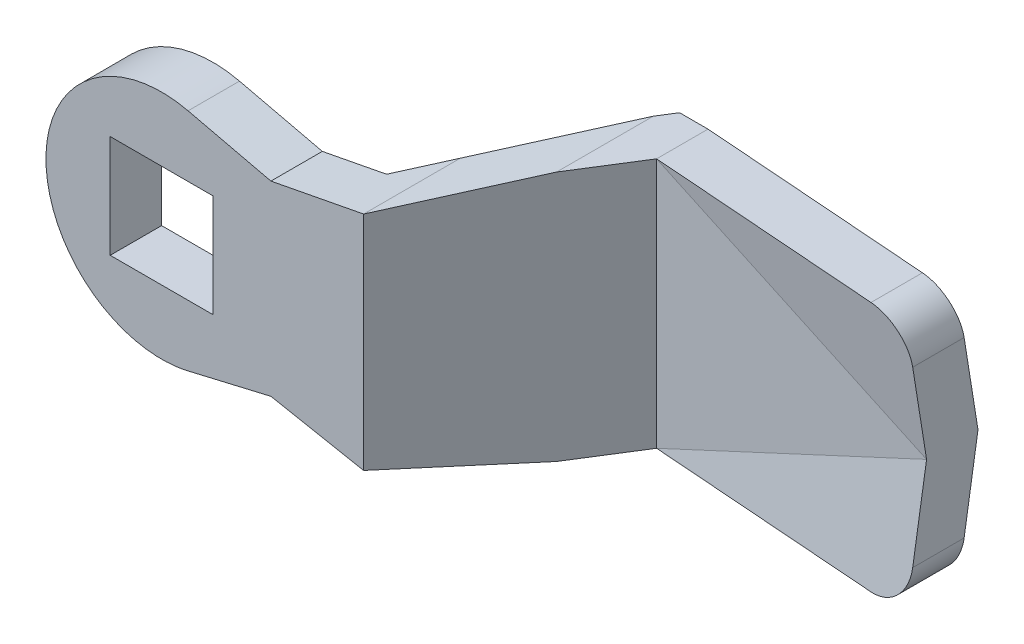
ISO-10303-21;
HEADER;
FILE_DESCRIPTION(('STEP AP214'),'2;1');
FILE_NAME('part.step','',(''),(''),'','','');
FILE_SCHEMA(('AUTOMOTIVE_DESIGN { 1 0 10303 214 1 1 1 1 }'));
ENDSEC;
DATA;
#1=APPLICATION_CONTEXT('core data for automotive mechanical design processes');
#2=APPLICATION_PROTOCOL_DEFINITION('international standard','automotive_design',2000,#1);
#3=PRODUCT_CONTEXT('',#1,'mechanical');
#4=PRODUCT('Part','Part','',(#3));
#5=PRODUCT_RELATED_PRODUCT_CATEGORY('part','',(#4));
#6=PRODUCT_DEFINITION_FORMATION('','',#4);
#7=PRODUCT_DEFINITION_CONTEXT('part definition',#1,'design');
#8=PRODUCT_DEFINITION('design','',#6,#7);
#9=PRODUCT_DEFINITION_SHAPE('','',#8);
#10=(LENGTH_UNIT() NAMED_UNIT(*) SI_UNIT(.MILLI.,.METRE.));
#11=(NAMED_UNIT(*) PLANE_ANGLE_UNIT() SI_UNIT($,.RADIAN.));
#12=(NAMED_UNIT(*) SI_UNIT($,.STERADIAN.) SOLID_ANGLE_UNIT());
#13=UNCERTAINTY_MEASURE_WITH_UNIT(LENGTH_MEASURE(1.E-05),#10,'distance_accuracy_value','');
#14=(GEOMETRIC_REPRESENTATION_CONTEXT(3) GLOBAL_UNCERTAINTY_ASSIGNED_CONTEXT((#13)) GLOBAL_UNIT_ASSIGNED_CONTEXT((#10,
#11,#12)) REPRESENTATION_CONTEXT('',''));
#15=CARTESIAN_POINT('',(0.,0.,0.));
#16=DIRECTION('',(0.,0.,1.));
#17=DIRECTION('',(1.,0.,0.));
#18=AXIS2_PLACEMENT_3D('',#15,#16,#17);
#19=CARTESIAN_POINT('',(33.507555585,-9.75,-19.));
#20=DIRECTION('',(0.,-1.,0.));
#21=DIRECTION('',(0.,0.,-1.));
#22=AXIS2_PLACEMENT_3D('',#19,#20,#21);
#23=PLANE('',#22);
#24=CARTESIAN_POINT('',(24.5,-9.74999999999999,-10.));
#25=DIRECTION('',(0.997254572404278,0.,0.0740494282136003));
#26=VECTOR('',#25,1.);
#27=LINE('',#24,#26);
#28=CARTESIAN_POINT('',(24.5,-9.75,-10.));
#29=VERTEX_POINT('',#28);
#30=CARTESIAN_POINT('',(42.51511117,-9.75,-8.66231881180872));
#31=VERTEX_POINT('',#30);
#32=EDGE_CURVE('E912',#29,#31,#27,.T.);
#33=ORIENTED_EDGE('',*,*,#32,.F.);
#34=CARTESIAN_POINT('',(24.5,-9.75,-10.));
#35=DIRECTION('',(0.,0.,-1.));
#36=VECTOR('',#35,1.);
#37=LINE('',#34,#36);
#38=CARTESIAN_POINT('',(24.5,-9.75,-14.));
#39=VERTEX_POINT('',#38);
#40=EDGE_CURVE('E319',#29,#39,#37,.T.);
#41=ORIENTED_EDGE('',*,*,#40,.T.);
#42=CARTESIAN_POINT('',(24.5,-9.75,-14.));
#43=DIRECTION('',(0.997254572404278,0.,0.0740494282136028));
#44=VECTOR('',#43,1.);
#45=LINE('',#42,#44);
#46=CARTESIAN_POINT('',(42.51511117,-9.75,-12.6623188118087));
#47=VERTEX_POINT('',#46);
#48=EDGE_CURVE('E880',#39,#47,#45,.T.);
#49=ORIENTED_EDGE('',*,*,#48,.T.);
#50=CARTESIAN_POINT('',(42.51511117,-9.74999999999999,-8.66231881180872));
#51=DIRECTION('',(0.,0.,-1.));
#52=VECTOR('',#51,1.);
#53=LINE('',#50,#52);
#54=EDGE_CURVE('E893',#31,#47,#53,.T.);
#55=ORIENTED_EDGE('',*,*,#54,.F.);
#56=EDGE_LOOP('',(#33,#41,#49,#55));
#57=FACE_BOUND('',#56,.T.);
#58=ADVANCED_FACE('F16',(#57),#23,.T.);
#59=CARTESIAN_POINT('',(36.,0.,-14.));
#60=DIRECTION('',(0.,0.,1.));
#61=DIRECTION('',(1.,0.,0.));
#62=AXIS2_PLACEMENT_3D('',#59,#60,#61);
#63=PLANE('',#62);
#64=CARTESIAN_POINT('',(24.5,9.75,-14.));
#65=DIRECTION('',(0.,-1.,0.));
#66=VECTOR('',#65,1.);
#67=LINE('',#64,#66);
#68=CARTESIAN_POINT('',(24.5,9.75,-14.));
#69=VERTEX_POINT('',#68);
#70=EDGE_CURVE('E407',#69,#39,#67,.T.);
#71=ORIENTED_EDGE('',*,*,#70,.F.);
#72=CARTESIAN_POINT('',(24.5,9.75,-14.));
#73=DIRECTION('',(0.907008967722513,-0.421111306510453,0.));
#74=VECTOR('',#73,1.);
#75=LINE('',#72,#74);
#76=CARTESIAN_POINT('',(45.499999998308,0.,-13.9999999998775));
#77=VERTEX_POINT('',#76);
#78=EDGE_CURVE('E868',#69,#77,#75,.T.);
#79=ORIENTED_EDGE('',*,*,#78,.T.);
#80=CARTESIAN_POINT('',(45.4999999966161,0.,-14.));
#81=DIRECTION('',(-0.907008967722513,-0.421111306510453,0.));
#82=VECTOR('',#81,1.);
#83=LINE('',#80,#82);
#84=EDGE_CURVE('E886',#77,#39,#83,.T.);
#85=ORIENTED_EDGE('',*,*,#84,.T.);
#86=EDGE_LOOP('',(#71,#79,#85));
#87=FACE_BOUND('',#86,.T.);
#88=ADVANCED_FACE('F1071',(#87),#63,.F.);
#89=CARTESIAN_POINT('',(36.,0.,-10.));
#90=DIRECTION('',(0.,0.,1.));
#91=DIRECTION('',(1.,0.,0.));
#92=AXIS2_PLACEMENT_3D('',#89,#90,#91);
#93=PLANE('',#92);
#94=CARTESIAN_POINT('',(24.5,9.74999999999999,-10.));
#95=DIRECTION('',(0.907008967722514,-0.421111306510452,0.));
#96=VECTOR('',#95,1.);
#97=LINE('',#94,#96);
#98=CARTESIAN_POINT('',(24.5,9.75,-10.));
#99=VERTEX_POINT('',#98);
#100=CARTESIAN_POINT('',(45.4999999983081,0.,-9.9999999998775));
#101=VERTEX_POINT('',#100);
#102=EDGE_CURVE('E214',#99,#101,#97,.T.);
#103=ORIENTED_EDGE('',*,*,#102,.F.);
#104=CARTESIAN_POINT('',(24.5,-9.75,-10.));
#105=DIRECTION('',(0.,1.,0.));
#106=VECTOR('',#105,1.);
#107=LINE('',#104,#106);
#108=EDGE_CURVE('E228',#29,#99,#107,.T.);
#109=ORIENTED_EDGE('',*,*,#108,.F.);
#110=CARTESIAN_POINT('',(45.4999999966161,0.,-10.));
#111=DIRECTION('',(-0.907008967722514,-0.421111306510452,0.));
#112=VECTOR('',#111,1.);
#113=LINE('',#110,#112);
#114=EDGE_CURVE('E231',#101,#29,#113,.T.);
#115=ORIENTED_EDGE('',*,*,#114,.F.);
#116=EDGE_LOOP('',(#103,#109,#115));
#117=FACE_BOUND('',#116,.T.);
#118=ADVANCED_FACE('F226',(#117),#93,.T.);
#119=CARTESIAN_POINT('',(39.2716939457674,-8.32058902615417,-9.1317591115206));
#120=DIRECTION('',(-0.0731252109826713,0.157500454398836,0.984807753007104));
#121=DIRECTION('',(0.907008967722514,0.421111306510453,0.));
#122=AXIS2_PLACEMENT_3D('',#119,#120,#121);
#123=PLANE('',#122);
#124=CARTESIAN_POINT('',(45.5,3.91852349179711E-11,-9.999999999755));
#125=DIRECTION('',(0.,-0.987451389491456,0.157923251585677));
#126=VECTOR('',#125,1.);
#127=LINE('',#124,#126);
#128=CARTESIAN_POINT('',(45.5,-6.75,-8.92047146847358));
#129=VERTEX_POINT('',#128);
#130=EDGE_CURVE('E804',#101,#129,#127,.T.);
#131=ORIENTED_EDGE('',*,*,#130,.F.);
#132=ORIENTED_EDGE('',*,*,#114,.T.);
#133=ORIENTED_EDGE('',*,*,#32,.T.);
#134=CARTESIAN_POINT('',(45.5,-6.74999999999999,-8.92047146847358));
#135=CARTESIAN_POINT('',(45.5000854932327,-6.78385605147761,-8.91505058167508));
#136=CARTESIAN_POINT('',(45.4995959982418,-6.8177205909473,-8.90967358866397));
#137=CARTESIAN_POINT('',(45.4974820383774,-6.88495412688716,-8.89908602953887));
#138=CARTESIAN_POINT('',(45.4958735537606,-6.91832342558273,-8.89387418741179));
#139=CARTESIAN_POINT('',(45.4915695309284,-6.98453077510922,-8.88361690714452));
#140=CARTESIAN_POINT('',(45.4888897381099,-7.01736964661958,-8.87857015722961));
#141=CARTESIAN_POINT('',(45.4824917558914,-7.08248352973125,-8.86864311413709));
#142=CARTESIAN_POINT('',(45.4787890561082,-7.11475985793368,-8.86376147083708));
#143=CARTESIAN_POINT('',(45.4703940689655,-7.17871907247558,-8.85416467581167));
#144=CARTESIAN_POINT('',(45.4657170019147,-7.21040374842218,-8.84944813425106));
#145=CARTESIAN_POINT('',(45.455422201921,-7.27315301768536,-8.84018158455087));
#146=CARTESIAN_POINT('',(45.4498194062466,-7.30421985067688,-8.8356301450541));
#147=CARTESIAN_POINT('',(45.437722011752,-7.36570964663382,-8.82669384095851));
#148=CARTESIAN_POINT('',(45.4312420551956,-7.39613527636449,-8.82230750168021));
#149=CARTESIAN_POINT('',(45.4174390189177,-7.45632163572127,-8.81370144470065));
#150=CARTESIAN_POINT('',(45.4101302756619,-7.48608543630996,-8.80948020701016));
#151=CARTESIAN_POINT('',(45.3947180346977,-7.54492977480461,-8.80120439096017));
#152=CARTESIAN_POINT('',(45.3866285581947,-7.57401376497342,-8.797148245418));
#153=CARTESIAN_POINT('',(45.3697028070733,-7.63148266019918,-8.78920269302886));
#154=CARTESIAN_POINT('',(45.3608802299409,-7.6598713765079,-8.78531166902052));
#155=CARTESIAN_POINT('',(45.3425356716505,-7.71593643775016,-8.77769629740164));
#156=CARTESIAN_POINT('',(45.3330270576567,-7.74361692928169,-8.77397028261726));
#157=CARTESIAN_POINT('',(45.3133573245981,-7.79825432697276,-8.76668539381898));
#158=CARTESIAN_POINT('',(45.303209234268,-7.82521569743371,-8.7631247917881));
#159=CARTESIAN_POINT('',(45.2797738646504,-7.88485105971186,-8.75532662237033));
#160=CARTESIAN_POINT('',(45.2662924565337,-7.91745250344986,-8.75111597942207));
#161=CARTESIAN_POINT('',(45.2382806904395,-7.98193740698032,-8.74288924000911));
#162=CARTESIAN_POINT('',(45.2237587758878,-8.01382438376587,-8.73887194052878));
#163=CARTESIAN_POINT('',(45.1937070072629,-8.07685170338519,-8.73103230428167));
#164=CARTESIAN_POINT('',(45.1781853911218,-8.10799582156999,-8.72720874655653));
#165=CARTESIAN_POINT('',(45.1461758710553,-8.16951038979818,-8.71975650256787));
#166=CARTESIAN_POINT('',(45.1296959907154,-8.19988486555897,-8.71612658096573));
#167=CARTESIAN_POINT('',(45.0958118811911,-8.25983541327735,-8.70906165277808));
#168=CARTESIAN_POINT('',(45.0784154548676,-8.28941574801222,-8.70562539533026));
#169=CARTESIAN_POINT('',(45.0427404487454,-8.34775535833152,-8.69894780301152));
#170=CARTESIAN_POINT('',(45.0244694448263,-8.37651912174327,-8.69570520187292));
#171=CARTESIAN_POINT('',(44.9870876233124,-8.43320503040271,-8.68941494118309));
#172=CARTESIAN_POINT('',(44.9679841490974,-8.46113187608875,-8.68636599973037));
#173=CARTESIAN_POINT('',(44.9289797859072,-8.51612543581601,-8.68046306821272));
#174=CARTESIAN_POINT('',(44.9090860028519,-8.54319705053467,-8.67760778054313));
#175=CARTESIAN_POINT('',(44.8685433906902,-8.59646364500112,-8.67209219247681));
#176=CARTESIAN_POINT('',(44.8479014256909,-8.62266371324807,-8.66943057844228));
#177=CARTESIAN_POINT('',(44.8059047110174,-8.67417267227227,-8.66430228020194));
#178=CARTESIAN_POINT('',(44.7845565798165,-8.69948682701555,-8.66183426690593));
#179=CARTESIAN_POINT('',(44.7411895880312,-8.74921135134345,-8.65709345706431));
#180=CARTESIAN_POINT('',(44.719177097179,-8.77362714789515,-8.65481931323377));
#181=CARTESIAN_POINT('',(44.6745232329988,-8.82154416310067,-8.65046525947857));
#182=CARTESIAN_POINT('',(44.6518879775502,-8.84505095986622,-8.64838399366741));
#183=CARTESIAN_POINT('',(44.6059662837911,-8.89120513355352,-8.6444138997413));
#184=CARTESIAN_POINT('',(44.582683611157,-8.91385617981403,-8.64252417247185));
#185=CARTESIAN_POINT('',(44.5353825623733,-8.95839785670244,-8.63892897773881));
#186=CARTESIAN_POINT('',(44.5113640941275,-8.98028839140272,-8.63722353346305));
#187=CARTESIAN_POINT('',(44.4626160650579,-9.02328477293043,-8.63399591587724));
#188=CARTESIAN_POINT('',(44.4378863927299,-9.04439049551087,-8.63247377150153));
#189=CARTESIAN_POINT('',(44.3877413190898,-9.08579382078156,-8.62961301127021));
#190=CARTESIAN_POINT('',(44.3623257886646,-9.10609126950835,-8.62827443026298));
#191=CARTESIAN_POINT('',(44.3108351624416,-9.14585541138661,-8.62578072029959));
#192=CARTESIAN_POINT('',(44.2847599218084,-9.16532191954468,-8.6246256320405));
#193=CARTESIAN_POINT('',(44.2319767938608,-9.20340238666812,-8.62249892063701));
#194=CARTESIAN_POINT('',(44.2052687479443,-9.22201612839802,-8.62152734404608));
#195=CARTESIAN_POINT('',(44.1512476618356,-9.25837013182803,-8.61976764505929));
#196=CARTESIAN_POINT('',(44.1239344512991,-9.27611014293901,-8.61897957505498));
#197=CARTESIAN_POINT('',(44.0687313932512,-9.31069664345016,-8.6175868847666));
#198=CARTESIAN_POINT('',(44.0408413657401,-9.32754284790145,-8.61698232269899));
#199=CARTESIAN_POINT('',(43.9845137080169,-9.3603226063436,-8.61595664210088));
#200=CARTESIAN_POINT('',(43.9560758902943,-9.37625584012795,-8.61553558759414));
#201=CARTESIAN_POINT('',(43.8986823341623,-9.40719146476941,-8.61487691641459));
#202=CARTESIAN_POINT('',(43.8697264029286,-9.4221934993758,-8.61463936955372));
#203=CARTESIAN_POINT('',(43.8113269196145,-9.45124949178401,-8.61434770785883));
#204=CARTESIAN_POINT('',(43.7818831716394,-9.46530305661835,-8.61429366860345));
#205=CARTESIAN_POINT('',(43.7225389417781,-9.4924458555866,-8.61436901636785));
#206=CARTESIAN_POINT('',(43.6926382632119,-9.50553465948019,-8.61449848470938));
#207=CARTESIAN_POINT('',(43.6324116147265,-9.53073268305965,-8.61494084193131));
#208=CARTESIAN_POINT('',(43.6020854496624,-9.54284143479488,-8.61525381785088));
#209=CARTESIAN_POINT('',(43.5410397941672,-9.56606512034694,-8.61606318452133));
#210=CARTESIAN_POINT('',(43.510320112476,-9.57717954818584,-8.61655966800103));
#211=CARTESIAN_POINT('',(43.4485198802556,-9.59840139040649,-8.61773604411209));
#212=CARTESIAN_POINT('',(43.4174391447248,-9.60850826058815,-8.61841603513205));
#213=CARTESIAN_POINT('',(43.3549497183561,-9.62770284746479,-8.61995942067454));
#214=CARTESIAN_POINT('',(43.3235408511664,-9.63678998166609,-8.62082291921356));
#215=CARTESIAN_POINT('',(43.2604284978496,-9.65393402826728,-8.62273331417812));
#216=CARTESIAN_POINT('',(43.2287248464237,-9.6619903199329,-8.62378032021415));
#217=CARTESIAN_POINT('',(43.1650566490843,-9.6770627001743,-8.6260577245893));
#218=CARTESIAN_POINT('',(43.1330919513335,-9.68407812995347,-8.62728823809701));
#219=CARTESIAN_POINT('',(43.0689357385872,-9.69705990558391,-8.62993265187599));
#220=CARTESIAN_POINT('',(43.0367440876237,-9.70302555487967,-8.63134667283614));
#221=CARTESIAN_POINT('',(42.9721683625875,-9.71390000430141,-8.63435809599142));
#222=CARTESIAN_POINT('',(42.939784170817,-9.71880807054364,-8.63595562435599));
#223=CARTESIAN_POINT('',(42.8748580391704,-9.72756070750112,-8.63933405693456));
#224=CARTESIAN_POINT('',(42.8423160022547,-9.73140450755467,-8.64111509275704));
#225=CARTESIAN_POINT('',(42.7771090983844,-9.73802312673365,-8.64486053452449));
#226=CARTESIAN_POINT('',(42.7444441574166,-9.74079713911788,-8.64682507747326));
#227=CARTESIAN_POINT('',(42.6790265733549,-9.74527175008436,-8.65093752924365));
#228=CARTESIAN_POINT('',(42.6462738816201,-9.74697150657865,-8.65308558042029));
#229=CARTESIAN_POINT('',(42.5807160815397,-9.74929467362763,-8.65756503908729));
#230=CARTESIAN_POINT('',(42.547910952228,-9.74991720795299,-8.65989659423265));
#231=CARTESIAN_POINT('',(42.51511117,-9.74999999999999,-8.66231881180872));
#232=B_SPLINE_CURVE_WITH_KNOTS('',3,(#134,#135,#136,#137,#138,#139,#140,#141,#142,#143,#144,
#145,#146,#147,#148,#149,#150,#151,#152,#153,#154,#155,#156,#157,#158,#159,#160,#161,#162,#163,
#164,#165,#166,#167,#168,#169,#170,#171,#172,#173,#174,#175,#176,#177,#178,#179,#180,#181,#182,
#183,#184,#185,#186,#187,#188,#189,#190,#191,#192,#193,#194,#195,#196,#197,#198,#199,#200,#201,
#202,#203,#204,#205,#206,#207,#208,#209,#210,#211,#212,#213,#214,#215,#216,#217,#218,#219,#220,
#221,#222,#223,#224,#225,#226,#227,#228,#229,#230,#231),.UNSPECIFIED.,.F.,.F.,(4,2,2,2,2,2,2,2,
2,2,2,2,2,2,2,2,2,2,2,2,2,2,2,2,2,2,2,2,2,2,2,2,2,2,2,2,2,2,2,2,2,2,2,2,2,2,2,2,4),(0.,
0.102857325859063,0.204275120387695,0.30425413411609,0.40279515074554,0.499898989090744,
0.595566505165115,0.689798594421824,0.782596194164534,0.873960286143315,0.963891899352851,
1.05239211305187,1.13946206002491,1.24602693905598,1.35180810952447,1.45680788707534,
1.56102863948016,1.66447278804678,1.7671428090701,1.86904123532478,1.97017065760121,
2.0705337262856,2.17013315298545,2.26897171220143,2.36705224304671,2.46464865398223,
2.56225733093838,2.65988139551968,2.7575239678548,2.85518816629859,2.95287710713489,
3.05059390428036,3.14834166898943,3.24612350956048,3.34394253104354,3.44180183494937,
3.53970451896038,3.63765367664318,3.73565239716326,3.83370376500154,3.93181085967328,
4.02997675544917,4.12820452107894,4.2264972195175,4.32485790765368,4.42328963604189,
4.52179544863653,4.6203783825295,4.71904146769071),.UNSPECIFIED.);
#233=EDGE_CURVE('E900',#129,#31,#232,.T.);
#234=ORIENTED_EDGE('',*,*,#233,.F.);
#235=EDGE_LOOP('',(#131,#132,#133,#234));
#236=FACE_BOUND('',#235,.T.);
#237=ADVANCED_FACE('F1093',(#236),#123,.T.);
#238=CARTESIAN_POINT('',(42.5075364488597,-6.75753654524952,-19.));
#239=DIRECTION('',(0.,0.,1.));
#240=DIRECTION('',(0.00253125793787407,-0.999996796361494,0.));
#241=AXIS2_PLACEMENT_3D('',#238,#239,#240);
#242=CYLINDRICAL_SURFACE('',#241,2.99247304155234);
#243=ORIENTED_EDGE('',*,*,#233,.T.);
#244=ORIENTED_EDGE('',*,*,#54,.T.);
#245=CARTESIAN_POINT('',(42.51511117,-9.74999999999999,-12.6623188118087));
#246=CARTESIAN_POINT('',(42.5479097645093,-9.74991721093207,-12.6598966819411));
#247=CARTESIAN_POINT('',(42.5807137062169,-9.74929471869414,-12.6575652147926));
#248=CARTESIAN_POINT('',(42.6462692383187,-9.74697171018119,-12.6530859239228));
#249=CARTESIAN_POINT('',(42.6790208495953,-9.74527206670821,-12.6509379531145));
#250=CARTESIAN_POINT('',(42.7444363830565,-9.74079774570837,-12.6468256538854));
#251=CARTESIAN_POINT('',(42.777100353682,-9.7380239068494,-12.6448611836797));
#252=CARTESIAN_POINT('',(42.8423054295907,-9.73140568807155,-12.6411158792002));
#253=CARTESIAN_POINT('',(42.8748466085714,-9.72756211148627,-12.6393349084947));
#254=CARTESIAN_POINT('',(42.9397711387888,-9.7188099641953,-12.6359565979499));
#255=CARTESIAN_POINT('',(42.9721545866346,-9.71390216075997,-12.6343591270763));
#256=CARTESIAN_POINT('',(43.0367289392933,-9.70302826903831,-12.6313478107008));
#257=CARTESIAN_POINT('',(43.0689199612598,-9.69706291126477,-12.6299338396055));
#258=CARTESIAN_POINT('',(43.1330750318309,-9.68408174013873,-12.6272895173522));
#259=CARTESIAN_POINT('',(43.1650392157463,-9.67706661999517,-12.626059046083));
#260=CARTESIAN_POINT('',(43.2287065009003,-9.66199486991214,-12.6237817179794));
#261=CARTESIAN_POINT('',(43.2604097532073,-9.65393889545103,-12.6227347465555));
#262=CARTESIAN_POINT('',(43.3235214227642,-9.63679548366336,-12.6208244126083));
#263=CARTESIAN_POINT('',(43.3549300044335,-9.62770866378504,-12.6199609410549));
#264=CARTESIAN_POINT('',(43.4174189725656,-9.60851469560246,-12.6184176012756));
#265=CARTESIAN_POINT('',(43.4484995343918,-9.59840812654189,-12.6177376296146));
#266=CARTESIAN_POINT('',(43.5102995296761,-9.57718686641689,-12.6165612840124));
#267=CARTESIAN_POINT('',(43.5410191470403,-9.56607271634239,-12.616064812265));
#268=CARTESIAN_POINT('',(43.6020647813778,-9.54284955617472,-12.6152554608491));
#269=CARTESIAN_POINT('',(43.6323909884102,-9.53074104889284,-12.614942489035));
#270=CARTESIAN_POINT('',(43.6926178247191,-9.50554347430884,-12.6145001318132));
#271=CARTESIAN_POINT('',(43.7225186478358,-9.49245487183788,-12.6143706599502));
#272=CARTESIAN_POINT('',(43.7818632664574,-9.46531242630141,-12.6142952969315));
#273=CARTESIAN_POINT('',(43.8113072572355,-9.45125901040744,-12.6143493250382));
#274=CARTESIAN_POINT('',(43.8697073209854,-9.4222032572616,-12.6146409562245));
#275=CARTESIAN_POINT('',(43.8986635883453,-9.40720130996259,-12.6148784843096));
#276=CARTESIAN_POINT('',(43.9560579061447,-9.37626579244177,-12.6155371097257));
#277=CARTESIAN_POINT('',(43.9844961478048,-9.36033257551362,-12.615958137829));
#278=CARTESIAN_POINT('',(44.040824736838,-9.32755277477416,-12.6169837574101));
#279=CARTESIAN_POINT('',(44.0687152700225,-9.31070650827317,-12.6175882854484));
#280=CARTESIAN_POINT('',(44.1239194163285,-9.27611979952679,-12.6189808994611));
#281=CARTESIAN_POINT('',(44.1512332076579,-9.25837963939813,-12.6197689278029));
#282=CARTESIAN_POINT('',(44.2052555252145,-9.22202524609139,-12.6215285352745));
#283=CARTESIAN_POINT('',(44.2319642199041,-9.20341126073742,-12.622500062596));
#284=CARTESIAN_POINT('',(44.284748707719,-9.16533020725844,-12.624626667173));
#285=CARTESIAN_POINT('',(44.3108246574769,-9.14586335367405,-12.6257816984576));
#286=CARTESIAN_POINT('',(44.3623167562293,-9.10609841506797,-12.6282752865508));
#287=CARTESIAN_POINT('',(44.387733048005,-9.08580051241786,-12.6296138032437));
#288=CARTESIAN_POINT('',(44.4378796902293,-9.04439616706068,-12.632474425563));
#289=CARTESIAN_POINT('',(44.4626101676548,-9.02328987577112,-12.6339964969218));
#290=CARTESIAN_POINT('',(44.5113598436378,-8.98029223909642,-12.6372239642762));
#291=CARTESIAN_POINT('',(44.5353791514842,-8.95840101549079,-12.6389293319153));
#292=CARTESIAN_POINT('',(44.582681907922,-8.913857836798,-12.6425243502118));
#293=CARTESIAN_POINT('',(44.6059654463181,-8.89120597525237,-12.6444139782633));
#294=CARTESIAN_POINT('',(44.6518847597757,-8.84505419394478,-12.6483835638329));
#295=CARTESIAN_POINT('',(44.6745169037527,-8.82155073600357,-12.6504643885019));
#296=CARTESIAN_POINT('',(44.7191653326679,-8.77363999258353,-12.6548176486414));
#297=CARTESIAN_POINT('',(44.7411754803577,-8.74922711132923,-12.6570914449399));
#298=CARTESIAN_POINT('',(44.7845385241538,-8.69950794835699,-12.6618316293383));
#299=CARTESIAN_POINT('',(44.8058850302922,-8.67419622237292,-12.6642993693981));
#300=CARTESIAN_POINT('',(44.8478791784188,-8.62269159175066,-12.6694271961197));
#301=CARTESIAN_POINT('',(44.8685201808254,-8.59649340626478,-12.6720886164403));
#302=CARTESIAN_POINT('',(44.9090614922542,-8.54322999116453,-12.6776038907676));
#303=CARTESIAN_POINT('',(44.9289549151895,-8.51615965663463,-12.6804590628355));
#304=CARTESIAN_POINT('',(44.9679591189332,-8.46116801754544,-12.6863618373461));
#305=CARTESIAN_POINT('',(44.9870627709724,-8.43324179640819,-12.6894107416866));
#306=CARTESIAN_POINT('',(45.0244454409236,-8.37655644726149,-12.6957010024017));
#307=CARTESIAN_POINT('',(45.0427170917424,-8.34779260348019,-12.6989436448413));
#308=CARTESIAN_POINT('',(45.0783938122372,-8.28945209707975,-12.7056213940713));
#309=CARTESIAN_POINT('',(45.0957912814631,-8.25987093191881,-12.7090577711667));
#310=CARTESIAN_POINT('',(45.1296778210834,-8.1999179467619,-12.7161230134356));
#311=CARTESIAN_POINT('',(45.1461590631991,-8.16954184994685,-12.7197531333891));
#312=CARTESIAN_POINT('',(45.1781715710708,-8.1080232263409,-12.7272058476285));
#313=CARTESIAN_POINT('',(45.1936947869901,-8.07687666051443,-12.7310296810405));
#314=CARTESIAN_POINT('',(45.2237499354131,-8.01384360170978,-12.7388699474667));
#315=CARTESIAN_POINT('',(45.2382736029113,-7.98195332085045,-12.7428876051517));
#316=CARTESIAN_POINT('',(45.2662889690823,-7.91746093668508,-12.7511151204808));
#317=CARTESIAN_POINT('',(45.2797721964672,-7.88485530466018,-12.7553261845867));
#318=CARTESIAN_POINT('',(45.3032082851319,-7.82521811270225,-12.7631243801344));
#319=CARTESIAN_POINT('',(45.313355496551,-7.79825918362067,-12.7666845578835));
#320=CARTESIAN_POINT('',(45.3330237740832,-7.74362627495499,-12.7739686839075));
#321=CARTESIAN_POINT('',(45.3425317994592,-7.71594782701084,-12.7776943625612));
#322=CARTESIAN_POINT('',(45.3608754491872,-7.65988643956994,-12.7853091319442));
#323=CARTESIAN_POINT('',(45.3696976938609,-7.63149934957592,-12.7891998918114));
#324=CARTESIAN_POINT('',(45.3866230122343,-7.57403327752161,-12.7971449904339));
#325=CARTESIAN_POINT('',(45.3947123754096,-7.54495048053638,-12.8012009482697));
#326=CARTESIAN_POINT('',(45.4101245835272,-7.48610808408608,-12.8094764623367));
#327=CARTESIAN_POINT('',(45.4174333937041,-7.45634502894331,-12.8136975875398));
#328=CARTESIAN_POINT('',(45.4312367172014,-7.39615970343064,-12.8223034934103));
#329=CARTESIAN_POINT('',(45.4377168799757,-7.36573435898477,-12.8266897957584));
#330=CARTESIAN_POINT('',(45.4498147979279,-7.30424466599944,-12.8356260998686));
#331=CARTESIAN_POINT('',(45.4554178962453,-7.27317764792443,-12.8401775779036));
#332=CARTESIAN_POINT('',(45.4657133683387,-7.21042753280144,-12.8494442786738));
#333=CARTESIAN_POINT('',(45.4703907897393,-7.17874219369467,-12.8541609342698));
#334=CARTESIAN_POINT('',(45.4787865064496,-7.11478117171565,-12.8637580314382));
#335=CARTESIAN_POINT('',(45.4824895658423,-7.08250369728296,-12.8686398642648));
#336=CARTESIAN_POINT('',(45.4888882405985,-7.01738703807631,-12.8785673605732));
#337=CARTESIAN_POINT('',(45.4915683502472,-6.98454653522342,-12.8836143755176));
#338=CARTESIAN_POINT('',(45.4958729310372,-6.91833543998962,-12.8938722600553));
#339=CARTESIAN_POINT('',(45.4974816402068,-6.88496402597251,-12.8990844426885));
#340=CARTESIAN_POINT('',(45.4995959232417,-6.81772578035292,-12.9096727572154));
#341=CARTESIAN_POINT('',(45.5000854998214,-6.78385864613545,-12.91505016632));
#342=CARTESIAN_POINT('',(45.5,-6.74999999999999,-12.9204714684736));
#343=B_SPLINE_CURVE_WITH_KNOTS('',3,(#245,#246,#247,#248,#249,#250,#251,#252,#253,#254,#255,
#256,#257,#258,#259,#260,#261,#262,#263,#264,#265,#266,#267,#268,#269,#270,#271,#272,#273,#274,
#275,#276,#277,#278,#279,#280,#281,#282,#283,#284,#285,#286,#287,#288,#289,#290,#291,#292,#293,
#294,#295,#296,#297,#298,#299,#300,#301,#302,#303,#304,#305,#306,#307,#308,#309,#310,#311,#312,
#313,#314,#315,#316,#317,#318,#319,#320,#321,#322,#323,#324,#325,#326,#327,#328,#329,#330,#331,
#332,#333,#334,#335,#336,#337,#338,#339,#340,#341,#342),.UNSPECIFIED.,.F.,.F.,(4,2,2,2,2,2,2,2,
2,2,2,2,2,2,2,2,2,2,2,2,2,2,2,2,2,2,2,2,2,2,2,2,2,2,2,2,2,2,2,2,2,2,2,2,2,2,2,2,4),(0.,
0.0986595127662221,0.197239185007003,0.295742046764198,0.394171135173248,0.492529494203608,
0.590820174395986,0.689046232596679,0.78721073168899,0.885316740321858,0.983367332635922,
1.08136558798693,1.1793145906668,1.27721742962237,1.37507719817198,1.47289699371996,
1.57067991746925,1.66842907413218,1.76614757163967,1.86383852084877,1.96150503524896,
2.05915023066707,2.15677722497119,2.25438913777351,2.35198909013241,2.45005588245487,
2.54888319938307,2.6484738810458,2.74883070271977,2.84995637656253,2.95185355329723,
3.05452482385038,3.15797272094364,3.26219972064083,3.36720824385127,3.47300065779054,
3.57957927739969,3.66664134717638,3.75513511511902,3.84506171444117,3.93642222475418,
4.02921767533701,4.12344904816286,4.21911728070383,4.31622326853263,4.41476786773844,
4.51475189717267,4.61617614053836,4.7190413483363),.UNSPECIFIED.);
#344=CARTESIAN_POINT('',(45.5,-6.75,-12.9204714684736));
#345=VERTEX_POINT('',#344);
#346=EDGE_CURVE('E874',#47,#345,#343,.T.);
#347=ORIENTED_EDGE('',*,*,#346,.T.);
#348=CARTESIAN_POINT('',(45.5,-6.75,-8.92047146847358));
#349=DIRECTION('',(0.,0.,-1.));
#350=VECTOR('',#349,1.);
#351=LINE('',#348,#350);
#352=EDGE_CURVE('E815',#129,#345,#351,.T.);
#353=ORIENTED_EDGE('',*,*,#352,.F.);
#354=EDGE_LOOP('',(#243,#244,#347,#353));
#355=FACE_BOUND('',#354,.T.);
#356=ADVANCED_FACE('F1104',(#355),#242,.T.);
#357=CARTESIAN_POINT('',(43.1592802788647,-11.9445137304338,-12.2635182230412));
#358=DIRECTION('',(-0.0731252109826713,0.157500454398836,0.984807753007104));
#359=DIRECTION('',(0.907008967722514,0.421111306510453,0.));
#360=AXIS2_PLACEMENT_3D('',#357,#358,#359);
#361=PLANE('',#360);
#362=ORIENTED_EDGE('',*,*,#346,.F.);
#363=ORIENTED_EDGE('',*,*,#48,.F.);
#364=ORIENTED_EDGE('',*,*,#84,.F.);
#365=CARTESIAN_POINT('',(45.5,-6.75,-12.9204714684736));
#366=DIRECTION('',(0.,0.987451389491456,-0.157923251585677));
#367=VECTOR('',#366,1.);
#368=LINE('',#365,#367);
#369=EDGE_CURVE('E825',#345,#77,#368,.T.);
#370=ORIENTED_EDGE('',*,*,#369,.F.);
#371=EDGE_LOOP('',(#362,#363,#364,#370));
#372=FACE_BOUND('',#371,.T.);
#373=ADVANCED_FACE('F1116',(#372),#361,.F.);
#374=CARTESIAN_POINT('',(43.1592802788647,11.9445137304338,-12.2635182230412));
#375=DIRECTION('',(-0.0731252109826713,-0.157500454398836,0.984807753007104));
#376=DIRECTION('',(-0.907008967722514,0.421111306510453,0.));
#377=AXIS2_PLACEMENT_3D('',#374,#375,#376);
#378=PLANE('',#377);
#379=ORIENTED_EDGE('',*,*,#78,.F.);
#380=CARTESIAN_POINT('',(42.51511117,9.75,-12.6623188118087));
#381=DIRECTION('',(-0.997254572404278,0.,-0.0740494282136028));
#382=VECTOR('',#381,1.);
#383=LINE('',#380,#382);
#384=CARTESIAN_POINT('',(42.51511117,9.75,-12.6623188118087));
#385=VERTEX_POINT('',#384);
#386=EDGE_CURVE('E196',#385,#69,#383,.T.);
#387=ORIENTED_EDGE('',*,*,#386,.F.);
#388=CARTESIAN_POINT('',(45.5,6.74999999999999,-12.9204714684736));
#389=CARTESIAN_POINT('',(45.5000854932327,6.78385605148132,-12.9150505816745));
#390=CARTESIAN_POINT('',(45.4995959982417,6.81772059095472,-12.9096735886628));
#391=CARTESIAN_POINT('',(45.4974820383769,6.88495412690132,-12.8990860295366));
#392=CARTESIAN_POINT('',(45.4958735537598,6.91832342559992,-12.893874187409));
#393=CARTESIAN_POINT('',(45.4915695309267,6.98453077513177,-12.8836169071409));
#394=CARTESIAN_POINT('',(45.4888897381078,7.01736964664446,-12.8785701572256));
#395=CARTESIAN_POINT('',(45.4824917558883,7.0824835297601,-12.8686431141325));
#396=CARTESIAN_POINT('',(45.4787890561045,7.11475985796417,-12.8637614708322));
#397=CARTESIAN_POINT('',(45.4703940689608,7.17871907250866,-12.8541646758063));
#398=CARTESIAN_POINT('',(45.4657170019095,7.21040374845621,-12.8494481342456));
#399=CARTESIAN_POINT('',(45.4554222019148,7.27315301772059,-12.8401815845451));
#400=CARTESIAN_POINT('',(45.44981940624,7.30421985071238,-12.8356301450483));
#401=CARTESIAN_POINT('',(45.4377220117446,7.36570964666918,-12.8266938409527));
#402=CARTESIAN_POINT('',(45.431242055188,7.39613527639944,-12.8223075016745));
#403=CARTESIAN_POINT('',(45.4174390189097,7.45632163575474,-12.8137014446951));
#404=CARTESIAN_POINT('',(45.4101302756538,7.48608543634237,-12.8094802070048));
#405=CARTESIAN_POINT('',(45.3947180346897,7.54492977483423,-12.8012043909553));
#406=CARTESIAN_POINT('',(45.3866285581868,7.57401376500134,-12.7971482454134));
#407=CARTESIAN_POINT('',(45.369702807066,7.63148266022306,-12.7892026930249));
#408=CARTESIAN_POINT('',(45.360880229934,7.65987137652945,-12.7853116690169));
#409=CARTESIAN_POINT('',(45.342535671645,7.71593643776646,-12.7776962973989));
#410=CARTESIAN_POINT('',(45.333027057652,7.74361692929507,-12.773970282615));
#411=CARTESIAN_POINT('',(45.3133573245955,7.79825432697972,-12.7666853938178));
#412=CARTESIAN_POINT('',(45.3032092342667,7.82521569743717,-12.7631247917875));
#413=CARTESIAN_POINT('',(45.2797738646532,7.88485105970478,-12.7553266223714));
#414=CARTESIAN_POINT('',(45.2662924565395,7.91745250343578,-12.7511159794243));
#415=CARTESIAN_POINT('',(45.2382806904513,7.98193740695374,-12.7428892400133));
#416=CARTESIAN_POINT('',(45.2237587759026,8.01382438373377,-12.7388719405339));
#417=CARTESIAN_POINT('',(45.1937070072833,8.0768517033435,-12.7310323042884));
#418=CARTESIAN_POINT('',(45.1781853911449,8.10799582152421,-12.727208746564));
#419=CARTESIAN_POINT('',(45.1461758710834,8.16951038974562,-12.7197565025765));
#420=CARTESIAN_POINT('',(45.1296959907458,8.1998848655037,-12.7161265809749));
#421=CARTESIAN_POINT('',(45.0958118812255,8.25983541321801,-12.709061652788));
#422=CARTESIAN_POINT('',(45.0784154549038,8.28941574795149,-12.7056253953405));
#423=CARTESIAN_POINT('',(45.0427404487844,8.34775535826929,-12.6989478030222));
#424=CARTESIAN_POINT('',(45.0244694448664,8.3765191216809,-12.6957052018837));
#425=CARTESIAN_POINT('',(44.9870876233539,8.43320503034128,-12.6894149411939));
#426=CARTESIAN_POINT('',(44.9679841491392,8.46113187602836,-12.686365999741));
#427=CARTESIAN_POINT('',(44.9289797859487,8.51612543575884,-12.680463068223));
#428=CARTESIAN_POINT('',(44.9090860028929,8.54319705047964,-12.6776077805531));
#429=CARTESIAN_POINT('',(44.868543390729,8.5964636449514,-12.672092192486));
#430=CARTESIAN_POINT('',(44.847901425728,8.62266371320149,-12.669430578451));
#431=CARTESIAN_POINT('',(44.8059047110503,8.67417267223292,-12.6643022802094));
#432=CARTESIAN_POINT('',(44.7845565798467,8.69948682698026,-12.6618342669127));
#433=CARTESIAN_POINT('',(44.7411895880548,8.74921135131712,-12.6570934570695));
#434=CARTESIAN_POINT('',(44.7191770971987,8.77362714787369,-12.654819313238));
#435=CARTESIAN_POINT('',(44.6745232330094,8.82154416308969,-12.6504652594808));
#436=CARTESIAN_POINT('',(44.6518879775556,8.84505095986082,-12.6483839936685));
#437=CARTESIAN_POINT('',(44.6059662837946,8.89120513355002,-12.6444138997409));
#438=CARTESIAN_POINT('',(44.5826836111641,8.91385617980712,-12.6425241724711));
#439=CARTESIAN_POINT('',(44.5353825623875,8.95839785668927,-12.6389289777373));
#440=CARTESIAN_POINT('',(44.5113640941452,8.98028839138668,-12.6372235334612));
#441=CARTESIAN_POINT('',(44.4626160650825,9.02328477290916,-12.6339959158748));
#442=CARTESIAN_POINT('',(44.4378863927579,9.04439049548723,-12.6324737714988));
#443=CARTESIAN_POINT('',(44.3877413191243,9.08579382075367,-12.6296130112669));
#444=CARTESIAN_POINT('',(44.3623257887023,9.10609126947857,-12.6282744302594));
#445=CARTESIAN_POINT('',(44.3108351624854,9.14585541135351,-12.6257807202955));
#446=CARTESIAN_POINT('',(44.2847599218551,9.16532191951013,-12.6246256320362));
#447=CARTESIAN_POINT('',(44.2319767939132,9.20340238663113,-12.6224989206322));
#448=CARTESIAN_POINT('',(44.2052687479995,9.22201612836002,-12.6215273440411));
#449=CARTESIAN_POINT('',(44.1512476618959,9.25837013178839,-12.6197676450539));
#450=CARTESIAN_POINT('',(44.1239344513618,9.27611014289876,-12.6189795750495));
#451=CARTESIAN_POINT('',(44.0687313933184,9.31069664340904,-12.6175868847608));
#452=CARTESIAN_POINT('',(44.0408413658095,9.32754284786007,-12.616982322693));
#453=CARTESIAN_POINT('',(43.9845137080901,9.36032260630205,-12.6159566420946));
#454=CARTESIAN_POINT('',(43.9560758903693,9.37625584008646,-12.6155355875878));
#455=CARTESIAN_POINT('',(43.8986823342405,9.40719146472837,-12.614876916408));
#456=CARTESIAN_POINT('',(43.8697264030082,9.42219349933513,-12.6146393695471));
#457=CARTESIAN_POINT('',(43.8113269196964,9.45124949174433,-12.6143477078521));
#458=CARTESIAN_POINT('',(43.7818831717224,9.4653030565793,-12.6142936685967));
#459=CARTESIAN_POINT('',(43.7225389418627,9.49244585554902,-12.614369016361));
#460=CARTESIAN_POINT('',(43.6926382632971,9.50553465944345,-12.6144984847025));
#461=CARTESIAN_POINT('',(43.6324116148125,9.53073268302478,-12.6149408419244));
#462=CARTESIAN_POINT('',(43.6020854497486,9.54284143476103,-12.615253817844));
#463=CARTESIAN_POINT('',(43.5410397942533,9.56606512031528,-12.6160631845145));
#464=CARTESIAN_POINT('',(43.5103201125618,9.57717954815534,-12.6165596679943));
#465=CARTESIAN_POINT('',(43.4485198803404,9.59840139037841,-12.6177360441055));
#466=CARTESIAN_POINT('',(43.4174391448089,9.60850826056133,-12.6184160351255));
#467=CARTESIAN_POINT('',(43.3549497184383,9.62770284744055,-12.6199594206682));
#468=CARTESIAN_POINT('',(43.3235408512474,9.63678998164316,-12.6208229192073));
#469=CARTESIAN_POINT('',(43.2604284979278,9.653934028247,-12.6227333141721));
#470=CARTESIAN_POINT('',(43.2287248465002,9.66199031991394,-12.6237803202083));
#471=CARTESIAN_POINT('',(43.165056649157,9.67706270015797,-12.6260577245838));
#472=CARTESIAN_POINT('',(43.133091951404,9.68407812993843,-12.6272882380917));
#473=CARTESIAN_POINT('',(43.068935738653,9.69705990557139,-12.629932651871));
#474=CARTESIAN_POINT('',(43.0367440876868,9.70302555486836,-12.6313466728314));
#475=CARTESIAN_POINT('',(42.972168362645,9.71390000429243,-12.6343580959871));
#476=CARTESIAN_POINT('',(42.9397841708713,9.71880807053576,-12.6359556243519));
#477=CARTESIAN_POINT('',(42.8748580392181,9.72756070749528,-12.639334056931));
#478=CARTESIAN_POINT('',(42.8423160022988,9.73140450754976,-12.6411150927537));
#479=CARTESIAN_POINT('',(42.7771090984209,9.73802312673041,-12.6448605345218));
#480=CARTESIAN_POINT('',(42.744444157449,9.74079713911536,-12.6468250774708));
#481=CARTESIAN_POINT('',(42.6790265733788,9.74527175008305,-12.6509375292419));
#482=CARTESIAN_POINT('',(42.6462738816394,9.74697150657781,-12.6530855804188));
#483=CARTESIAN_POINT('',(42.5807160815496,9.74929467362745,-12.6575650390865));
#484=CARTESIAN_POINT('',(42.5479109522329,9.74991720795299,-12.6598965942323));
#485=CARTESIAN_POINT('',(42.51511117,9.75000000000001,-12.6623188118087));
#486=B_SPLINE_CURVE_WITH_KNOTS('',3,(#388,#389,#390,#391,#392,#393,#394,#395,#396,#397,#398,
#399,#400,#401,#402,#403,#404,#405,#406,#407,#408,#409,#410,#411,#412,#413,#414,#415,#416,#417,
#418,#419,#420,#421,#422,#423,#424,#425,#426,#427,#428,#429,#430,#431,#432,#433,#434,#435,#436,
#437,#438,#439,#440,#441,#442,#443,#444,#445,#446,#447,#448,#449,#450,#451,#452,#453,#454,#455,
#456,#457,#458,#459,#460,#461,#462,#463,#464,#465,#466,#467,#468,#469,#470,#471,#472,#473,#474,
#475,#476,#477,#478,#479,#480,#481,#482,#483,#484,#485),.UNSPECIFIED.,.F.,.F.,(4,2,2,2,2,2,2,2,
2,2,2,2,2,2,2,2,2,2,2,2,2,2,2,2,2,2,2,2,2,2,2,2,2,2,2,2,2,2,2,2,2,2,2,2,2,2,2,2,4),(0.,
0.102857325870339,0.204275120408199,0.30425413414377,0.402795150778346,0.499898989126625,
0.595566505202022,0.689798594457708,0.782596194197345,0.873960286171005,0.963891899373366,
1.05239211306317,1.13946206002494,1.24602693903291,1.35180810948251,1.45680788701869,
1.56102863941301,1.66447278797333,1.76714280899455,1.86904123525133,1.97017065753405,
2.07053372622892,2.17013315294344,2.26897171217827,2.36705224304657,2.46464865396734,
2.56225733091,2.65988139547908,2.75752396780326,2.8551881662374,2.95287710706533,
3.05059390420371,3.14834166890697,3.24612350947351,3.34394253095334,3.44180183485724,
3.53970451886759,3.63765367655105,3.73565239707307,3.83370376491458,3.93181085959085,
4.02997675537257,4.12820452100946,4.22649721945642,4.32485790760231,4.42328963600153,
4.52179544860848,4.62037838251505,4.71904146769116),.UNSPECIFIED.);
#487=CARTESIAN_POINT('',(45.5,6.75,-12.9204714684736));
#488=VERTEX_POINT('',#487);
#489=EDGE_CURVE('E726',#488,#385,#486,.T.);
#490=ORIENTED_EDGE('',*,*,#489,.F.);
#491=CARTESIAN_POINT('',(45.5,-3.91813317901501E-11,-13.999999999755));
#492=DIRECTION('',(0.,0.987451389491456,0.157923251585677));
#493=VECTOR('',#492,1.);
#494=LINE('',#491,#493);
#495=EDGE_CURVE('E234',#77,#488,#494,.T.);
#496=ORIENTED_EDGE('',*,*,#495,.F.);
#497=EDGE_LOOP('',(#379,#387,#490,#496));
#498=FACE_BOUND('',#497,.T.);
#499=ADVANCED_FACE('F1128',(#498),#378,.F.);
#500=CARTESIAN_POINT('',(33.507555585,9.75,-19.));
#501=DIRECTION('',(0.,1.,0.));
#502=DIRECTION('',(1.,0.,0.));
#503=AXIS2_PLACEMENT_3D('',#500,#501,#502);
#504=PLANE('',#503);
#505=CARTESIAN_POINT('',(42.51511117,9.75,-8.66231881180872));
#506=DIRECTION('',(-0.997254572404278,0.,-0.0740494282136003));
#507=VECTOR('',#506,1.);
#508=LINE('',#505,#507);
#509=CARTESIAN_POINT('',(42.51511117,9.75,-8.66231881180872));
#510=VERTEX_POINT('',#509);
#511=EDGE_CURVE('E193',#510,#99,#508,.T.);
#512=ORIENTED_EDGE('',*,*,#511,.F.);
#513=CARTESIAN_POINT('',(42.51511117,9.75000000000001,-12.6623188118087));
#514=DIRECTION('',(0.,0.,1.));
#515=VECTOR('',#514,1.);
#516=LINE('',#513,#515);
#517=EDGE_CURVE('E842',#385,#510,#516,.T.);
#518=ORIENTED_EDGE('',*,*,#517,.F.);
#519=ORIENTED_EDGE('',*,*,#386,.T.);
#520=CARTESIAN_POINT('',(24.5,9.75,-14.));
#521=DIRECTION('',(0.,0.,1.));
#522=VECTOR('',#521,1.);
#523=LINE('',#520,#522);
#524=EDGE_CURVE('E188',#69,#99,#523,.T.);
#525=ORIENTED_EDGE('',*,*,#524,.T.);
#526=EDGE_LOOP('',(#512,#518,#519,#525));
#527=FACE_BOUND('',#526,.T.);
#528=ADVANCED_FACE('F191',(#527),#504,.T.);
#529=CARTESIAN_POINT('',(39.2716939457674,8.32058902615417,-9.1317591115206));
#530=DIRECTION('',(-0.0731252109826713,-0.157500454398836,0.984807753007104));
#531=DIRECTION('',(-0.907008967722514,0.421111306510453,0.));
#532=AXIS2_PLACEMENT_3D('',#529,#530,#531);
#533=PLANE('',#532);
#534=CARTESIAN_POINT('',(45.5,6.75,-8.92047146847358));
#535=DIRECTION('',(0.,-0.987451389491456,-0.157923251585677));
#536=VECTOR('',#535,1.);
#537=LINE('',#534,#536);
#538=CARTESIAN_POINT('',(45.5,6.75,-8.92047146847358));
#539=VERTEX_POINT('',#538);
#540=EDGE_CURVE('E793',#539,#101,#537,.T.);
#541=ORIENTED_EDGE('',*,*,#540,.F.);
#542=CARTESIAN_POINT('',(42.51511117,9.75000000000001,-8.66231881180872));
#543=CARTESIAN_POINT('',(42.5479097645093,9.74991721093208,-8.65989668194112));
#544=CARTESIAN_POINT('',(42.5807137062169,9.74929471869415,-8.6575652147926));
#545=CARTESIAN_POINT('',(42.6462692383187,9.7469717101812,-8.65308592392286));
#546=CARTESIAN_POINT('',(42.6790208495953,9.74527206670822,-8.65093795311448));
#547=CARTESIAN_POINT('',(42.7444363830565,9.74079774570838,-8.64682565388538));
#548=CARTESIAN_POINT('',(42.777100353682,9.73802390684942,-8.64486118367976));
#549=CARTESIAN_POINT('',(42.8423054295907,9.73140568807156,-8.64111587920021));
#550=CARTESIAN_POINT('',(42.8748466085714,9.72756211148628,-8.63933490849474));
#551=CARTESIAN_POINT('',(42.9397711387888,9.71880996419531,-8.63595659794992));
#552=CARTESIAN_POINT('',(42.9721545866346,9.71390216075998,-8.63435912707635));
#553=CARTESIAN_POINT('',(43.0367289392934,9.70302826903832,-8.63134781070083));
#554=CARTESIAN_POINT('',(43.0689199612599,9.69706291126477,-8.6299338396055));
#555=CARTESIAN_POINT('',(43.1330750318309,9.68408174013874,-8.62728951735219));
#556=CARTESIAN_POINT('',(43.1650392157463,9.67706661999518,-8.62605904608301));
#557=CARTESIAN_POINT('',(43.2287065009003,9.66199486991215,-8.6237817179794));
#558=CARTESIAN_POINT('',(43.2604097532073,9.65393889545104,-8.62273474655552));
#559=CARTESIAN_POINT('',(43.3235214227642,9.63679548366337,-8.62082441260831));
#560=CARTESIAN_POINT('',(43.3549300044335,9.62770866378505,-8.61996094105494));
#561=CARTESIAN_POINT('',(43.4174189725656,9.60851469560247,-8.61841760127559));
#562=CARTESIAN_POINT('',(43.4484995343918,9.59840812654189,-8.61773762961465));
#563=CARTESIAN_POINT('',(43.5102995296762,9.57718686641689,-8.61656128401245));
#564=CARTESIAN_POINT('',(43.5410191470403,9.5660727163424,-8.61606481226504));
#565=CARTESIAN_POINT('',(43.6020647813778,9.54284955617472,-8.61525546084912));
#566=CARTESIAN_POINT('',(43.6323909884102,9.53074104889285,-8.61494248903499));
#567=CARTESIAN_POINT('',(43.6926178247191,9.50554347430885,-8.61450013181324));
#568=CARTESIAN_POINT('',(43.7225186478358,9.49245487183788,-8.61437065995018));
#569=CARTESIAN_POINT('',(43.7818632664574,9.46531242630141,-8.61429529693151));
#570=CARTESIAN_POINT('',(43.8113072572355,9.45125901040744,-8.61434932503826));
#571=CARTESIAN_POINT('',(43.8697073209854,9.4222032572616,-8.61464095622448));
#572=CARTESIAN_POINT('',(43.8986635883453,9.40720130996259,-8.61487848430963));
#573=CARTESIAN_POINT('',(43.9560579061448,9.37626579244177,-8.61553710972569));
#574=CARTESIAN_POINT('',(43.9844961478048,9.36033257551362,-8.615958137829));
#575=CARTESIAN_POINT('',(44.040824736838,9.32755277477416,-8.61698375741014));
#576=CARTESIAN_POINT('',(44.0687152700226,9.31070650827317,-8.61758828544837));
#577=CARTESIAN_POINT('',(44.1239194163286,9.27611979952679,-8.61898089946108));
#578=CARTESIAN_POINT('',(44.1512332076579,9.25837963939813,-8.61976892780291));
#579=CARTESIAN_POINT('',(44.2052555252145,9.22202524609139,-8.62152853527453));
#580=CARTESIAN_POINT('',(44.2319642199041,9.20341126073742,-8.622500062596));
#581=CARTESIAN_POINT('',(44.284748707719,9.16533020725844,-8.62462666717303));
#582=CARTESIAN_POINT('',(44.3108246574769,9.14586335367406,-8.62578169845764));
#583=CARTESIAN_POINT('',(44.3623167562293,9.10609841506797,-8.62827528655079));
#584=CARTESIAN_POINT('',(44.387733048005,9.08580051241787,-8.6296138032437));
#585=CARTESIAN_POINT('',(44.4378796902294,9.04439616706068,-8.63247442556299));
#586=CARTESIAN_POINT('',(44.4626101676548,9.02328987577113,-8.6339964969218));
#587=CARTESIAN_POINT('',(44.5113598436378,8.98029223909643,-8.63722396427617));
#588=CARTESIAN_POINT('',(44.5353791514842,8.9584010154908,-8.63892933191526));
#589=CARTESIAN_POINT('',(44.582681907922,8.91385783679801,-8.64252435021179));
#590=CARTESIAN_POINT('',(44.6059654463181,8.89120597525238,-8.64441397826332));
#591=CARTESIAN_POINT('',(44.6518847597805,8.84505419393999,-8.64838356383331));
#592=CARTESIAN_POINT('',(44.674516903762,8.82155073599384,-8.65046438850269));
#593=CARTESIAN_POINT('',(44.7191653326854,8.7736399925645,-8.65481764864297));
#594=CARTESIAN_POINT('',(44.7411754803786,8.74922711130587,-8.65709144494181));
#595=CARTESIAN_POINT('',(44.7845385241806,8.69950794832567,-8.6618316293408));
#596=CARTESIAN_POINT('',(44.8058850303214,8.674196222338,-8.66429936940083));
#597=CARTESIAN_POINT('',(44.8478791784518,8.62269159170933,-8.6694271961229));
#598=CARTESIAN_POINT('',(44.8685201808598,8.59649340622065,-8.67208861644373));
#599=CARTESIAN_POINT('',(44.9090614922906,8.54322999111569,-8.67760389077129));
#600=CARTESIAN_POINT('',(44.9289549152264,8.51615965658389,-8.68045906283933));
#601=CARTESIAN_POINT('',(44.9679591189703,8.46116801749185,-8.68636183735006));
#602=CARTESIAN_POINT('',(44.9870627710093,8.43324179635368,-8.68941074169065));
#603=CARTESIAN_POINT('',(45.0244454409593,8.37655644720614,-8.69570100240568));
#604=CARTESIAN_POINT('',(45.0427170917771,8.34779260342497,-8.69894364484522));
#605=CARTESIAN_POINT('',(45.0783938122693,8.28945209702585,-8.70562139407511));
#606=CARTESIAN_POINT('',(45.0957912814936,8.25987093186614,-8.70905777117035));
#607=CARTESIAN_POINT('',(45.1296778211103,8.19991794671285,-8.71612301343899));
#608=CARTESIAN_POINT('',(45.146159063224,8.1695418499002,-8.7197531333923));
#609=CARTESIAN_POINT('',(45.1781715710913,8.10802322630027,-8.72720584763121));
#610=CARTESIAN_POINT('',(45.1936947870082,8.07687666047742,-8.73102968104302));
#611=CARTESIAN_POINT('',(45.2237499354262,8.01384360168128,-8.73886994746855));
#612=CARTESIAN_POINT('',(45.2382736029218,7.98195332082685,-8.74288760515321));
#613=CARTESIAN_POINT('',(45.2662889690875,7.91746093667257,-8.75111512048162));
#614=CARTESIAN_POINT('',(45.2797721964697,7.88485530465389,-8.75532618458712));
#615=CARTESIAN_POINT('',(45.3032082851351,7.82521811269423,-8.76312438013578));
#616=CARTESIAN_POINT('',(45.313355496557,7.79825918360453,-8.76668455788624));
#617=CARTESIAN_POINT('',(45.3330237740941,7.74362627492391,-8.7739686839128));
#618=CARTESIAN_POINT('',(45.3425317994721,7.71594782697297,-8.77769436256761));
#619=CARTESIAN_POINT('',(45.3608754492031,7.65988643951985,-8.78530913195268));
#620=CARTESIAN_POINT('',(45.3696976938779,7.63149934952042,-8.78919989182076));
#621=CARTESIAN_POINT('',(45.3866230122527,7.57403327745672,-8.79714499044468));
#622=CARTESIAN_POINT('',(45.3947123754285,7.54495048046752,-8.80120094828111));
#623=CARTESIAN_POINT('',(45.4101245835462,7.48610808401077,-8.80947646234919));
#624=CARTESIAN_POINT('',(45.4174333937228,7.45634502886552,-8.81369758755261));
#625=CARTESIAN_POINT('',(45.4312367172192,7.39615970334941,-8.82230349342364));
#626=CARTESIAN_POINT('',(45.4377168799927,7.36573435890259,-8.82668979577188));
#627=CARTESIAN_POINT('',(45.4498147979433,7.30424466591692,-8.835626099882));
#628=CARTESIAN_POINT('',(45.4554178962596,7.27317764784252,-8.84017757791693));
#629=CARTESIAN_POINT('',(45.4657133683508,7.21042753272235,-8.8494442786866));
#630=CARTESIAN_POINT('',(45.4703907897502,7.17874219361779,-8.85416093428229));
#631=CARTESIAN_POINT('',(45.4787865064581,7.11478117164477,-8.86375803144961));
#632=CARTESIAN_POINT('',(45.4824895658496,7.0825036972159,-8.86863986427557));
#633=CARTESIAN_POINT('',(45.4888882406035,7.01738703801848,-8.87856736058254));
#634=CARTESIAN_POINT('',(45.4915683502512,6.98454653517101,-8.88361437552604));
#635=CARTESIAN_POINT('',(45.4958729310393,6.91833543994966,-8.89387226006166));
#636=CARTESIAN_POINT('',(45.4974816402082,6.88496402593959,-8.89908444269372));
#637=CARTESIAN_POINT('',(45.4995959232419,6.81772578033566,-8.90967275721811));
#638=CARTESIAN_POINT('',(45.5000854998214,6.78385864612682,-8.91505016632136));
#639=CARTESIAN_POINT('',(45.5,6.74999999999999,-8.92047146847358));
#640=B_SPLINE_CURVE_WITH_KNOTS('',3,(#542,#543,#544,#545,#546,#547,#548,#549,#550,#551,#552,
#553,#554,#555,#556,#557,#558,#559,#560,#561,#562,#563,#564,#565,#566,#567,#568,#569,#570,#571,
#572,#573,#574,#575,#576,#577,#578,#579,#580,#581,#582,#583,#584,#585,#586,#587,#588,#589,#590,
#591,#592,#593,#594,#595,#596,#597,#598,#599,#600,#601,#602,#603,#604,#605,#606,#607,#608,#609,
#610,#611,#612,#613,#614,#615,#616,#617,#618,#619,#620,#621,#622,#623,#624,#625,#626,#627,#628,
#629,#630,#631,#632,#633,#634,#635,#636,#637,#638,#639),.UNSPECIFIED.,.F.,.F.,(4,2,2,2,2,2,2,2,
2,2,2,2,2,2,2,2,2,2,2,2,2,2,2,2,2,2,2,2,2,2,2,2,2,2,2,2,2,2,2,2,2,2,2,2,2,2,2,2,4),(0.,
0.0986595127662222,0.19723918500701,0.295742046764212,0.394171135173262,0.492529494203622,
0.590820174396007,0.6890462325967,0.787210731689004,0.885316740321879,0.983367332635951,
1.08136558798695,1.17931459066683,1.2772174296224,1.375077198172,1.47289699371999,
1.57067991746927,1.6684290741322,1.76614757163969,1.86383852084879,1.96150503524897,
2.05915023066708,2.1567772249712,2.25438913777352,2.35198909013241,2.4500558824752,
2.54888319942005,2.64847388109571,2.74883070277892,2.84995637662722,2.95185355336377,
3.05452482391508,3.15797272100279,3.26219972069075,3.36720824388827,3.47300065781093,
3.57957927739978,3.66664134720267,3.75513511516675,3.84506171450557,3.9364222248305,
4.02921767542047,4.1234490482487,4.21911728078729,4.31622326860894,4.41476786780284,
4.51475189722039,4.61617614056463,4.71904134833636),.UNSPECIFIED.);
#641=EDGE_CURVE('E218',#510,#539,#640,.T.);
#642=ORIENTED_EDGE('',*,*,#641,.F.);
#643=ORIENTED_EDGE('',*,*,#511,.T.);
#644=ORIENTED_EDGE('',*,*,#102,.T.);
#645=EDGE_LOOP('',(#541,#642,#643,#644));
#646=FACE_BOUND('',#645,.T.);
#647=ADVANCED_FACE('F213',(#646),#533,.T.);
#648=CARTESIAN_POINT('',(45.5,0.,-19.));
#649=DIRECTION('',(1.,0.,0.));
#650=DIRECTION('',(0.,1.,0.));
#651=AXIS2_PLACEMENT_3D('',#648,#649,#650);
#652=PLANE('',#651);
#653=ORIENTED_EDGE('',*,*,#352,.T.);
#654=ORIENTED_EDGE('',*,*,#369,.T.);
#655=ORIENTED_EDGE('',*,*,#495,.T.);
#656=CARTESIAN_POINT('',(45.5,6.74999999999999,-8.92047146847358));
#657=DIRECTION('',(0.,0.,-1.));
#658=VECTOR('',#657,1.);
#659=LINE('',#656,#658);
#660=EDGE_CURVE('E206',#539,#488,#659,.T.);
#661=ORIENTED_EDGE('',*,*,#660,.F.);
#662=ORIENTED_EDGE('',*,*,#540,.T.);
#663=ORIENTED_EDGE('',*,*,#130,.T.);
#664=EDGE_LOOP('',(#653,#654,#655,#661,#662,#663));
#665=FACE_BOUND('',#664,.T.);
#666=ADVANCED_FACE('F740',(#665),#652,.T.);
#667=CARTESIAN_POINT('',(42.5075364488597,6.75753654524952,-19.));
#668=DIRECTION('',(0.,0.,1.));
#669=DIRECTION('',(0.999996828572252,-0.00251850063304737,0.));
#670=AXIS2_PLACEMENT_3D('',#667,#668,#669);
#671=CYLINDRICAL_SURFACE('',#670,2.99247304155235);
#672=ORIENTED_EDGE('',*,*,#641,.T.);
#673=ORIENTED_EDGE('',*,*,#660,.T.);
#674=ORIENTED_EDGE('',*,*,#489,.T.);
#675=ORIENTED_EDGE('',*,*,#517,.T.);
#676=EDGE_LOOP('',(#672,#673,#674,#675));
#677=FACE_BOUND('',#676,.T.);
#678=ADVANCED_FACE('F731',(#677),#671,.T.);
#679=CARTESIAN_POINT('',(9.,0.,-2.5));
#680=DIRECTION('',(0.,0.,1.));
#681=DIRECTION('',(1.,0.,0.));
#682=AXIS2_PLACEMENT_3D('',#679,#680,#681);
#683=PLANE('',#682);
#684=CARTESIAN_POINT('',(11.5,-3.,-2.5));
#685=DIRECTION('',(-1.,0.,0.));
#686=VECTOR('',#685,1.);
#687=LINE('',#684,#686);
#688=CARTESIAN_POINT('',(11.5,-3.,-2.5));
#689=VERTEX_POINT('',#688);
#690=CARTESIAN_POINT('',(6.5,-3.,-2.5));
#691=VERTEX_POINT('',#690);
#692=EDGE_CURVE('E704',#689,#691,#687,.T.);
#693=ORIENTED_EDGE('',*,*,#692,.T.);
#694=CARTESIAN_POINT('',(6.5,-3.,-2.5));
#695=DIRECTION('',(0.,1.,0.));
#696=VECTOR('',#695,1.);
#697=LINE('',#694,#696);
#698=CARTESIAN_POINT('',(6.5,3.,-2.5));
#699=VERTEX_POINT('',#698);
#700=EDGE_CURVE('E623',#691,#699,#697,.T.);
#701=ORIENTED_EDGE('',*,*,#700,.T.);
#702=CARTESIAN_POINT('',(6.5,3.,-2.5));
#703=DIRECTION('',(1.,0.,0.));
#704=VECTOR('',#703,1.);
#705=LINE('',#702,#704);
#706=CARTESIAN_POINT('',(11.5,3.,-2.5));
#707=VERTEX_POINT('',#706);
#708=EDGE_CURVE('E685',#699,#707,#705,.T.);
#709=ORIENTED_EDGE('',*,*,#708,.T.);
#710=CARTESIAN_POINT('',(11.5,3.,-2.5));
#711=DIRECTION('',(0.,-1.,0.));
#712=VECTOR('',#711,1.);
#713=LINE('',#710,#712);
#714=EDGE_CURVE('E535',#707,#689,#713,.T.);
#715=ORIENTED_EDGE('',*,*,#714,.T.);
#716=EDGE_LOOP('',(#693,#701,#709,#715));
#717=FACE_BOUND('',#716,.T.);
#718=ADVANCED_FACE('F654',(#717),#683,.F.);
#719=CARTESIAN_POINT('',(24.5,9.75,-30.));
#720=DIRECTION('',(0.,-1.,0.));
#721=DIRECTION('',(0.,0.,-1.));
#722=AXIS2_PLACEMENT_3D('',#719,#720,#721);
#723=PLANE('',#722);
#724=CARTESIAN_POINT('',(21.5,9.75,-12.744478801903));
#725=DIRECTION('',(0.,0.,1.));
#726=VECTOR('',#725,1.);
#727=LINE('',#724,#726);
#728=CARTESIAN_POINT('',(21.5,9.75,-12.744478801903));
#729=VERTEX_POINT('',#728);
#730=CARTESIAN_POINT('',(21.5,9.75,-5.22082044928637));
#731=VERTEX_POINT('',#730);
#732=EDGE_CURVE('E242',#729,#731,#727,.T.);
#733=ORIENTED_EDGE('',*,*,#732,.T.);
#734=CARTESIAN_POINT('',(24.5,9.75,-10.));
#735=DIRECTION('',(-0.531656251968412,0.,0.84696022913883));
#736=VECTOR('',#735,1.);
#737=LINE('',#734,#736);
#738=EDGE_CURVE('E238',#99,#731,#737,.T.);
#739=ORIENTED_EDGE('',*,*,#738,.F.);
#740=ORIENTED_EDGE('',*,*,#524,.F.);
#741=CARTESIAN_POINT('',(22.28811929,9.75,-14.));
#742=DIRECTION('',(1.,0.,0.));
#743=VECTOR('',#742,1.);
#744=LINE('',#741,#743);
#745=CARTESIAN_POINT('',(22.28811929,9.75,-14.));
#746=VERTEX_POINT('',#745);
#747=EDGE_CURVE('E643',#746,#69,#744,.T.);
#748=ORIENTED_EDGE('',*,*,#747,.F.);
#749=CARTESIAN_POINT('',(21.5,9.75,-12.744478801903));
#750=DIRECTION('',(0.531656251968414,0.,-0.846960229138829));
#751=VECTOR('',#750,1.);
#752=LINE('',#749,#751);
#753=EDGE_CURVE('E205',#729,#746,#752,.T.);
#754=ORIENTED_EDGE('',*,*,#753,.F.);
#755=EDGE_LOOP('',(#733,#739,#740,#748,#754));
#756=FACE_BOUND('',#755,.T.);
#757=ADVANCED_FACE('F240',(#756),#723,.F.);
#758=CARTESIAN_POINT('',(6.5,0.,-1.25));
#759=DIRECTION('',(1.,0.,0.));
#760=DIRECTION('',(0.,1.,0.));
#761=AXIS2_PLACEMENT_3D('',#758,#759,#760);
#762=PLANE('',#761);
#763=ORIENTED_EDGE('',*,*,#700,.F.);
#764=CARTESIAN_POINT('',(6.5,-3.,-2.5));
#765=DIRECTION('',(0.,0.,1.));
#766=VECTOR('',#765,1.);
#767=LINE('',#764,#766);
#768=CARTESIAN_POINT('',(6.5,-3.,0.));
#769=VERTEX_POINT('',#768);
#770=EDGE_CURVE('E499',#691,#769,#767,.T.);
#771=ORIENTED_EDGE('',*,*,#770,.T.);
#772=CARTESIAN_POINT('',(6.5,-3.,0.));
#773=DIRECTION('',(0.,1.,0.));
#774=VECTOR('',#773,1.);
#775=LINE('',#772,#774);
#776=CARTESIAN_POINT('',(6.5,3.,0.));
#777=VERTEX_POINT('',#776);
#778=EDGE_CURVE('E603',#769,#777,#775,.T.);
#779=ORIENTED_EDGE('',*,*,#778,.T.);
#780=CARTESIAN_POINT('',(6.5,3.,0.));
#781=DIRECTION('',(0.,0.,-1.));
#782=VECTOR('',#781,1.);
#783=LINE('',#780,#782);
#784=EDGE_CURVE('E633',#777,#699,#783,.T.);
#785=ORIENTED_EDGE('',*,*,#784,.T.);
#786=EDGE_LOOP('',(#763,#771,#779,#785));
#787=FACE_BOUND('',#786,.T.);
#788=ADVANCED_FACE('F572',(#787),#762,.F.);
#789=CARTESIAN_POINT('',(9.,3.,-1.25));
#790=DIRECTION('',(0.,-1.,0.));
#791=DIRECTION('',(0.,0.,-1.));
#792=AXIS2_PLACEMENT_3D('',#789,#790,#791);
#793=PLANE('',#792);
#794=ORIENTED_EDGE('',*,*,#708,.F.);
#795=ORIENTED_EDGE('',*,*,#784,.F.);
#796=CARTESIAN_POINT('',(6.5,3.,0.));
#797=DIRECTION('',(1.,0.,0.));
#798=VECTOR('',#797,1.);
#799=LINE('',#796,#798);
#800=CARTESIAN_POINT('',(11.5,3.,0.));
#801=VERTEX_POINT('',#800);
#802=EDGE_CURVE('E558',#777,#801,#799,.T.);
#803=ORIENTED_EDGE('',*,*,#802,.T.);
#804=CARTESIAN_POINT('',(11.5,3.,0.));
#805=DIRECTION('',(0.,0.,-1.));
#806=VECTOR('',#805,1.);
#807=LINE('',#804,#806);
#808=EDGE_CURVE('E525',#801,#707,#807,.T.);
#809=ORIENTED_EDGE('',*,*,#808,.T.);
#810=EDGE_LOOP('',(#794,#795,#803,#809));
#811=FACE_BOUND('',#810,.T.);
#812=ADVANCED_FACE('F563',(#811),#793,.F.);
#813=CARTESIAN_POINT('',(11.5,0.,-1.25));
#814=DIRECTION('',(-1.,0.,0.));
#815=DIRECTION('',(0.,0.,1.));
#816=AXIS2_PLACEMENT_3D('',#813,#814,#815);
#817=PLANE('',#816);
#818=ORIENTED_EDGE('',*,*,#714,.F.);
#819=ORIENTED_EDGE('',*,*,#808,.F.);
#820=CARTESIAN_POINT('',(11.5,3.,0.));
#821=DIRECTION('',(0.,-1.,0.));
#822=VECTOR('',#821,1.);
#823=LINE('',#820,#822);
#824=CARTESIAN_POINT('',(11.5,-3.,0.));
#825=VERTEX_POINT('',#824);
#826=EDGE_CURVE('E513',#801,#825,#823,.T.);
#827=ORIENTED_EDGE('',*,*,#826,.T.);
#828=CARTESIAN_POINT('',(11.5,-3.,0.));
#829=DIRECTION('',(0.,0.,-1.));
#830=VECTOR('',#829,1.);
#831=LINE('',#828,#830);
#832=EDGE_CURVE('E545',#825,#689,#831,.T.);
#833=ORIENTED_EDGE('',*,*,#832,.T.);
#834=EDGE_LOOP('',(#818,#819,#827,#833));
#835=FACE_BOUND('',#834,.T.);
#836=ADVANCED_FACE('F479',(#835),#817,.F.);
#837=CARTESIAN_POINT('',(9.,-3.,-1.25));
#838=DIRECTION('',(0.,1.,0.));
#839=DIRECTION('',(1.,0.,0.));
#840=AXIS2_PLACEMENT_3D('',#837,#838,#839);
#841=PLANE('',#840);
#842=ORIENTED_EDGE('',*,*,#692,.F.);
#843=ORIENTED_EDGE('',*,*,#832,.F.);
#844=CARTESIAN_POINT('',(11.5,-3.,0.));
#845=DIRECTION('',(-1.,0.,0.));
#846=VECTOR('',#845,1.);
#847=LINE('',#844,#846);
#848=EDGE_CURVE('E464',#825,#769,#847,.T.);
#849=ORIENTED_EDGE('',*,*,#848,.T.);
#850=ORIENTED_EDGE('',*,*,#770,.F.);
#851=EDGE_LOOP('',(#842,#843,#849,#850));
#852=FACE_BOUND('',#851,.T.);
#853=ADVANCED_FACE('F470',(#852),#841,.F.);
#854=CARTESIAN_POINT('',(18.605940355,9.19345007,-30.));
#855=DIRECTION('',(0.188847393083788,-0.982006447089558,0.));
#856=DIRECTION('',(0.,0.,-1.));
#857=AXIS2_PLACEMENT_3D('',#854,#855,#856);
#858=PLANE('',#857);
#859=CARTESIAN_POINT('',(15.71188071,8.63690014,4.));
#860=DIRECTION('',(0.,0.,-1.));
#861=VECTOR('',#860,1.);
#862=LINE('',#859,#861);
#863=CARTESIAN_POINT('',(15.71188071,8.63690013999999,4.));
#864=VERTEX_POINT('',#863);
#865=CARTESIAN_POINT('',(15.71188071,8.63690014,-3.52365835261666));
#866=VERTEX_POINT('',#865);
#867=EDGE_CURVE('E438',#864,#866,#862,.T.);
#868=ORIENTED_EDGE('',*,*,#867,.F.);
#869=CARTESIAN_POINT('',(21.5,9.75,-5.22082044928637));
#870=DIRECTION('',(-0.528899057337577,-0.101711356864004,0.842567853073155));
#871=VECTOR('',#870,1.);
#872=LINE('',#869,#871);
#873=EDGE_CURVE('E249',#731,#864,#872,.T.);
#874=ORIENTED_EDGE('',*,*,#873,.F.);
#875=ORIENTED_EDGE('',*,*,#732,.F.);
#876=CARTESIAN_POINT('',(15.71188071,8.63690014,-3.52365835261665));
#877=DIRECTION('',(0.528899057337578,0.101711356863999,-0.842567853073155));
#878=VECTOR('',#877,1.);
#879=LINE('',#876,#878);
#880=EDGE_CURVE('E448',#866,#729,#879,.T.);
#881=ORIENTED_EDGE('',*,*,#880,.F.);
#882=EDGE_LOOP('',(#868,#874,#875,#881));
#883=FACE_BOUND('',#882,.T.);
#884=ADVANCED_FACE('F387',(#883),#858,.F.);
#885=CARTESIAN_POINT('',(23.394059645,15.,-14.));
#886=DIRECTION('',(0.,0.,-1.));
#887=DIRECTION('',(0.,-1.,0.));
#888=AXIS2_PLACEMENT_3D('',#885,#886,#887);
#889=PLANE('',#888);
#890=ORIENTED_EDGE('',*,*,#747,.T.);
#891=ORIENTED_EDGE('',*,*,#70,.T.);
#892=CARTESIAN_POINT('',(24.5,-9.75,-14.));
#893=DIRECTION('',(-1.,0.,0.));
#894=VECTOR('',#893,1.);
#895=LINE('',#892,#894);
#896=CARTESIAN_POINT('',(22.28811929,-9.75,-14.));
#897=VERTEX_POINT('',#896);
#898=EDGE_CURVE('E330',#39,#897,#895,.T.);
#899=ORIENTED_EDGE('',*,*,#898,.T.);
#900=CARTESIAN_POINT('',(22.28811929,9.75,-14.));
#901=DIRECTION('',(0.,-1.,0.));
#902=VECTOR('',#901,1.);
#903=LINE('',#900,#902);
#904=EDGE_CURVE('E1738',#746,#897,#903,.T.);
#905=ORIENTED_EDGE('',*,*,#904,.F.);
#906=EDGE_LOOP('',(#890,#891,#899,#905));
#907=FACE_BOUND('',#906,.T.);
#908=ADVANCED_FACE('F378',(#907),#889,.T.);
#909=CARTESIAN_POINT('',(24.5,-9.75,-30.));
#910=DIRECTION('',(0.,1.,0.));
#911=DIRECTION('',(1.,0.,0.));
#912=AXIS2_PLACEMENT_3D('',#909,#910,#911);
#913=PLANE('',#912);
#914=CARTESIAN_POINT('',(21.5,-9.75,-5.22082044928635));
#915=DIRECTION('',(0.,0.,-1.));
#916=VECTOR('',#915,1.);
#917=LINE('',#914,#916);
#918=CARTESIAN_POINT('',(21.5,-9.75,-5.22082044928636));
#919=VERTEX_POINT('',#918);
#920=CARTESIAN_POINT('',(21.5,-9.75,-12.744478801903));
#921=VERTEX_POINT('',#920);
#922=EDGE_CURVE('E352',#919,#921,#917,.T.);
#923=ORIENTED_EDGE('',*,*,#922,.T.);
#924=CARTESIAN_POINT('',(22.28811929,-9.75,-14.));
#925=DIRECTION('',(-0.531656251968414,0.,0.846960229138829));
#926=VECTOR('',#925,1.);
#927=LINE('',#924,#926);
#928=EDGE_CURVE('E341',#897,#921,#927,.T.);
#929=ORIENTED_EDGE('',*,*,#928,.F.);
#930=ORIENTED_EDGE('',*,*,#898,.F.);
#931=ORIENTED_EDGE('',*,*,#40,.F.);
#932=CARTESIAN_POINT('',(21.5,-9.75,-5.22082044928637));
#933=DIRECTION('',(0.531656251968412,0.,-0.84696022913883));
#934=VECTOR('',#933,1.);
#935=LINE('',#932,#934);
#936=EDGE_CURVE('E256',#919,#29,#935,.T.);
#937=ORIENTED_EDGE('',*,*,#936,.F.);
#938=EDGE_LOOP('',(#923,#929,#930,#931,#937));
#939=FACE_BOUND('',#938,.T.);
#940=ADVANCED_FACE('F277',(#939),#913,.F.);
#941=CARTESIAN_POINT('',(20.105940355,15.,-3.));
#942=DIRECTION('',(0.84696022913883,0.,0.531656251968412));
#943=DIRECTION('',(0.,-1.,0.));
#944=AXIS2_PLACEMENT_3D('',#941,#942,#943);
#945=PLANE('',#944);
#946=CARTESIAN_POINT('',(15.71188071,-8.63690014,4.));
#947=DIRECTION('',(0.,1.,0.));
#948=VECTOR('',#947,1.);
#949=LINE('',#946,#948);
#950=CARTESIAN_POINT('',(15.7118807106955,-8.63690013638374,4.));
#951=VERTEX_POINT('',#950);
#952=EDGE_CURVE('E1781',#951,#864,#949,.T.);
#953=ORIENTED_EDGE('',*,*,#952,.F.);
#954=CARTESIAN_POINT('',(15.71188071,-8.63690014,3.99999999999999));
#955=DIRECTION('',(0.528899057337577,-0.101711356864,-0.842567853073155));
#956=VECTOR('',#955,1.);
#957=LINE('',#954,#956);
#958=EDGE_CURVE('E305',#951,#919,#957,.T.);
#959=ORIENTED_EDGE('',*,*,#958,.T.);
#960=ORIENTED_EDGE('',*,*,#936,.T.);
#961=ORIENTED_EDGE('',*,*,#108,.T.);
#962=ORIENTED_EDGE('',*,*,#738,.T.);
#963=ORIENTED_EDGE('',*,*,#873,.T.);
#964=EDGE_LOOP('',(#953,#959,#960,#961,#962,#963));
#965=FACE_BOUND('',#964,.T.);
#966=ADVANCED_FACE('F254',(#965),#945,.T.);
#967=CARTESIAN_POINT('',(12.105940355,7.94345007,0.));
#968=DIRECTION('',(-0.188847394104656,0.982006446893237,0.));
#969=DIRECTION('',(0.,0.,1.));
#970=AXIS2_PLACEMENT_3D('',#967,#968,#969);
#971=PLANE('',#970);
#972=CARTESIAN_POINT('',(13.5,8.21153846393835,0.));
#973=DIRECTION('',(-0.982006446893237,-0.188847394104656,0.));
#974=VECTOR('',#973,1.);
#975=LINE('',#972,#974);
#976=CARTESIAN_POINT('',(13.5,8.21153846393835,0.));
#977=VERTEX_POINT('',#976);
#978=CARTESIAN_POINT('',(8.5,7.25,0.));
#979=VERTEX_POINT('',#978);
#980=EDGE_CURVE('E1654',#977,#979,#975,.T.);
#981=ORIENTED_EDGE('',*,*,#980,.T.);
#982=CARTESIAN_POINT('',(8.5,7.25,4.));
#983=DIRECTION('',(0.,0.,-1.));
#984=VECTOR('',#983,1.);
#985=LINE('',#982,#984);
#986=CARTESIAN_POINT('',(8.5,7.25,4.));
#987=VERTEX_POINT('',#986);
#988=EDGE_CURVE('E1416',#987,#979,#985,.T.);
#989=ORIENTED_EDGE('',*,*,#988,.F.);
#990=CARTESIAN_POINT('',(15.71188071,8.63690014,4.));
#991=DIRECTION('',(-0.982006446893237,-0.188847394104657,0.));
#992=VECTOR('',#991,1.);
#993=LINE('',#990,#992);
#994=EDGE_CURVE('E1804',#864,#987,#993,.T.);
#995=ORIENTED_EDGE('',*,*,#994,.F.);
#996=ORIENTED_EDGE('',*,*,#867,.T.);
#997=CARTESIAN_POINT('',(13.5,8.21153846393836,0.));
#998=DIRECTION('',(0.528899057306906,0.101711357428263,-0.842567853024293));
#999=VECTOR('',#998,1.);
#1000=LINE('',#997,#999);
#1001=EDGE_CURVE('E1721',#977,#866,#1000,.T.);
#1002=ORIENTED_EDGE('',*,*,#1001,.F.);
#1003=EDGE_LOOP('',(#981,#989,#995,#996,#1002));
#1004=FACE_BOUND('',#1003,.T.);
#1005=ADVANCED_FACE('F276',(#1004),#971,.T.);
#1006=CARTESIAN_POINT('',(5.277956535,8.006016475,0.));
#1007=DIRECTION('',(0.22843478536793,0.973559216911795,0.));
#1008=DIRECTION('',(0.,0.,-1.));
#1009=AXIS2_PLACEMENT_3D('',#1006,#1007,#1008);
#1010=PLANE('',#1009);
#1011=CARTESIAN_POINT('',(8.5,7.25,0.));
#1012=DIRECTION('',(-0.973559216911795,0.22843478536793,0.));
#1013=VECTOR('',#1012,1.);
#1014=LINE('',#1011,#1013);
#1015=CARTESIAN_POINT('',(2.05591307,8.76203295,0.));
#1016=VERTEX_POINT('',#1015);
#1017=EDGE_CURVE('E1663',#979,#1016,#1014,.T.);
#1018=ORIENTED_EDGE('',*,*,#1017,.T.);
#1019=CARTESIAN_POINT('',(2.05591307,8.76203295,4.));
#1020=DIRECTION('',(0.,0.,-1.));
#1021=VECTOR('',#1020,1.);
#1022=LINE('',#1019,#1021);
#1023=CARTESIAN_POINT('',(2.05591307,8.76203295,4.));
#1024=VERTEX_POINT('',#1023);
#1025=EDGE_CURVE('E1438',#1024,#1016,#1022,.T.);
#1026=ORIENTED_EDGE('',*,*,#1025,.F.);
#1027=CARTESIAN_POINT('',(8.5,7.25,4.));
#1028=DIRECTION('',(-0.973559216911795,0.22843478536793,0.));
#1029=VECTOR('',#1028,1.);
#1030=LINE('',#1027,#1029);
#1031=EDGE_CURVE('E1813',#987,#1024,#1030,.T.);
#1032=ORIENTED_EDGE('',*,*,#1031,.F.);
#1033=ORIENTED_EDGE('',*,*,#988,.T.);
#1034=EDGE_LOOP('',(#1018,#1026,#1032,#1033));
#1035=FACE_BOUND('',#1034,.T.);
#1036=ADVANCED_FACE('F1425',(#1035),#1010,.T.);
#1037=CARTESIAN_POINT('',(-1.43440992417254E-09,0.,0.));
#1038=DIRECTION('',(0.,0.,1.));
#1039=DIRECTION('',(0.228434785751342,0.973559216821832,0.));
#1040=AXIS2_PLACEMENT_3D('',#1037,#1038,#1039);
#1041=CYLINDRICAL_SURFACE('',#1040,8.99999999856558);
#1042=ORIENTED_EDGE('',*,*,#1025,.T.);
#1043=CARTESIAN_POINT('',(-1.43440992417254E-09,0.,0.));
#1044=DIRECTION('',(0.,0.,1.));
#1045=DIRECTION('',(0.228434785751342,0.973559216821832,0.));
#1046=AXIS2_PLACEMENT_3D('',#1043,#1044,#1045);
#1047=CIRCLE('',#1046,8.99999999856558);
#1048=CARTESIAN_POINT('',(-2.05591307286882,-8.76203295,0.));
#1049=VERTEX_POINT('',#1048);
#1050=EDGE_CURVE('E1672',#1016,#1049,#1047,.T.);
#1051=ORIENTED_EDGE('',*,*,#1050,.T.);
#1052=CARTESIAN_POINT('',(-2.0559130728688,-8.76203295,4.));
#1053=DIRECTION('',(0.,0.,-1.));
#1054=VECTOR('',#1053,1.);
#1055=LINE('',#1052,#1054);
#1056=CARTESIAN_POINT('',(-2.05591307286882,-8.76203295,4.));
#1057=VERTEX_POINT('',#1056);
#1058=EDGE_CURVE('E1551',#1057,#1049,#1055,.T.);
#1059=ORIENTED_EDGE('',*,*,#1058,.F.);
#1060=CARTESIAN_POINT('',(2.05591307,8.76203295,4.));
#1061=CARTESIAN_POINT('',(1.1931985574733,8.96445926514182,4.));
#1062=CARTESIAN_POINT('',(0.30702144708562,8.9947616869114,4.));
#1063=CARTESIAN_POINT('',(-0.5783337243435,9.02503600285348,4.));
#1064=CARTESIAN_POINT('',(-1.45366883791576,8.88182677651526,4.));
#1065=CARTESIAN_POINT('',(-2.32791838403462,8.73879515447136,4.));
#1066=CARTESIAN_POINT('',(-3.15849544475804,8.42756824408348,4.));
#1067=CARTESIAN_POINT('',(-3.98804244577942,8.11672730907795,4.));
#1068=CARTESIAN_POINT('',(-4.74194284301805,7.6494429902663,4.));
#1069=CARTESIAN_POINT('',(-5.49490827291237,7.1827381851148,4.));
#1070=CARTESIAN_POINT('',(-6.14316003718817,6.57735393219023,4.));
#1071=CARTESIAN_POINT('',(-6.79060785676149,5.97272046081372,4.));
#1072=CARTESIAN_POINT('',(-7.30829903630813,5.25250085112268,4.));
#1073=CARTESIAN_POINT('',(-7.82534818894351,4.53317443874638,4.));
#1074=CARTESIAN_POINT('',(-8.19258420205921,3.72579710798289,4.));
#1075=CARTESIAN_POINT('',(-8.55936477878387,2.91942106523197,4.));
#1076=CARTESIAN_POINT('',(-8.76203295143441,2.05591307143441,4.));
#1077=CARTESIAN_POINT('',(-8.96444978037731,1.19347597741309,4.));
#1078=CARTESIAN_POINT('',(-8.99476168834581,0.307021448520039,4.));
#1079=CARTESIAN_POINT('',(-9.02503600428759,-0.578333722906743,4.));
#1080=CARTESIAN_POINT('',(-8.88182677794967,-1.45366883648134,4.));
#1081=CARTESIAN_POINT('',(-8.73879515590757,-2.32791838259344,4.));
#1082=CARTESIAN_POINT('',(-8.42756824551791,-3.15849544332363,4.));
#1083=CARTESIAN_POINT('',(-8.11672731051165,-3.98804244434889,4.));
#1084=CARTESIAN_POINT('',(-7.64944299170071,-4.74194284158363,4.));
#1085=CARTESIAN_POINT('',(-7.18273818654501,-5.494908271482,4.));
#1086=CARTESIAN_POINT('',(-6.57735393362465,-6.14316003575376,4.));
#1087=CARTESIAN_POINT('',(-5.97272046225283,-6.7906078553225,4.));
#1088=CARTESIAN_POINT('',(-5.25250085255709,-7.30829903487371,4.));
#1089=CARTESIAN_POINT('',(-4.53317444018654,-7.82534818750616,4.));
#1090=CARTESIAN_POINT('',(-3.7257971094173,-8.19258420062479,4.));
#1091=CARTESIAN_POINT('',(-2.91916823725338,-8.55947977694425,4.));
#1092=CARTESIAN_POINT('',(-2.05591307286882,-8.76203295,4.));
#1093=B_SPLINE_CURVE_WITH_KNOTS('',2,(#1060,#1061,#1062,#1063,#1064,#1065,#1066,#1067,#1068,
#1069,#1070,#1071,#1072,#1073,#1074,#1075,#1076,#1077,#1078,#1079,#1080,#1081,#1082,#1083,#1084,
#1085,#1086,#1087,#1088,#1089,#1090,#1091,#1092),.UNSPECIFIED.,.F.,.F.,(3,2,2,2,2,2,2,2,2,2,2,2,
2,2,2,2,3),(0.,0.0625,0.125,0.1875,0.25,0.3125,0.375,0.4375,0.5,0.5625,0.625,0.6875,0.75,0.8125,
0.875,0.9375,1.),.UNSPECIFIED.);
#1094=EDGE_CURVE('E1822',#1024,#1057,#1093,.T.);
#1095=ORIENTED_EDGE('',*,*,#1094,.F.);
#1096=EDGE_LOOP('',(#1042,#1051,#1059,#1095));
#1097=FACE_BOUND('',#1096,.T.);
#1098=ADVANCED_FACE('F1447',(#1097),#1041,.T.);
#1099=CARTESIAN_POINT('',(0.,-4.,3.));
#1100=DIRECTION('',(0.,1.,0.));
#1101=DIRECTION('',(1.,0.,0.));
#1102=AXIS2_PLACEMENT_3D('',#1099,#1100,#1101);
#1103=PLANE('',#1102);
#1104=CARTESIAN_POINT('',(4.,-4.,4.));
#1105=DIRECTION('',(-1.,0.,0.));
#1106=VECTOR('',#1105,1.);
#1107=LINE('',#1104,#1106);
#1108=CARTESIAN_POINT('',(4.,-4.,4.));
#1109=VERTEX_POINT('',#1108);
#1110=CARTESIAN_POINT('',(-4.,-4.,4.));
#1111=VERTEX_POINT('',#1110);
#1112=EDGE_CURVE('E1839',#1109,#1111,#1107,.T.);
#1113=ORIENTED_EDGE('',*,*,#1112,.F.);
#1114=CARTESIAN_POINT('',(4.,-4.,0.));
#1115=DIRECTION('',(0.,0.,1.));
#1116=VECTOR('',#1115,1.);
#1117=LINE('',#1114,#1116);
#1118=CARTESIAN_POINT('',(4.,-4.,0.));
#1119=VERTEX_POINT('',#1118);
#1120=EDGE_CURVE('E1518',#1119,#1109,#1117,.T.);
#1121=ORIENTED_EDGE('',*,*,#1120,.F.);
#1122=CARTESIAN_POINT('',(4.,-4.,0.));
#1123=DIRECTION('',(-1.,0.,0.));
#1124=VECTOR('',#1123,1.);
#1125=LINE('',#1122,#1124);
#1126=CARTESIAN_POINT('',(-4.,-4.,0.));
#1127=VERTEX_POINT('',#1126);
#1128=EDGE_CURVE('E1644',#1119,#1127,#1125,.T.);
#1129=ORIENTED_EDGE('',*,*,#1128,.T.);
#1130=CARTESIAN_POINT('',(-4.,-4.,4.));
#1131=DIRECTION('',(0.,0.,-1.));
#1132=VECTOR('',#1131,1.);
#1133=LINE('',#1130,#1132);
#1134=EDGE_CURVE('E1460',#1111,#1127,#1133,.T.);
#1135=ORIENTED_EDGE('',*,*,#1134,.F.);
#1136=EDGE_LOOP('',(#1113,#1121,#1129,#1135));
#1137=FACE_BOUND('',#1136,.T.);
#1138=ADVANCED_FACE('F1469',(#1137),#1103,.T.);
#1139=CARTESIAN_POINT('',(-4.,0.,3.));
#1140=DIRECTION('',(1.,0.,0.));
#1141=DIRECTION('',(0.,1.,0.));
#1142=AXIS2_PLACEMENT_3D('',#1139,#1140,#1141);
#1143=PLANE('',#1142);
#1144=CARTESIAN_POINT('',(-4.,-4.,4.));
#1145=DIRECTION('',(0.,1.,0.));
#1146=VECTOR('',#1145,1.);
#1147=LINE('',#1144,#1146);
#1148=CARTESIAN_POINT('',(-4.,4.,4.));
#1149=VERTEX_POINT('',#1148);
#1150=EDGE_CURVE('E1848',#1111,#1149,#1147,.T.);
#1151=ORIENTED_EDGE('',*,*,#1150,.F.);
#1152=ORIENTED_EDGE('',*,*,#1134,.T.);
#1153=CARTESIAN_POINT('',(-4.,-4.,0.));
#1154=DIRECTION('',(0.,1.,0.));
#1155=VECTOR('',#1154,1.);
#1156=LINE('',#1153,#1155);
#1157=CARTESIAN_POINT('',(-4.,4.,0.));
#1158=VERTEX_POINT('',#1157);
#1159=EDGE_CURVE('E1618',#1127,#1158,#1156,.T.);
#1160=ORIENTED_EDGE('',*,*,#1159,.T.);
#1161=CARTESIAN_POINT('',(-4.,4.,4.));
#1162=DIRECTION('',(0.,0.,-1.));
#1163=VECTOR('',#1162,1.);
#1164=LINE('',#1161,#1163);
#1165=EDGE_CURVE('E1494',#1149,#1158,#1164,.T.);
#1166=ORIENTED_EDGE('',*,*,#1165,.F.);
#1167=EDGE_LOOP('',(#1151,#1152,#1160,#1166));
#1168=FACE_BOUND('',#1167,.T.);
#1169=ADVANCED_FACE('F1481',(#1168),#1143,.T.);
#1170=CARTESIAN_POINT('',(0.,4.,3.));
#1171=DIRECTION('',(0.,-1.,0.));
#1172=DIRECTION('',(0.,0.,-1.));
#1173=AXIS2_PLACEMENT_3D('',#1170,#1171,#1172);
#1174=PLANE('',#1173);
#1175=CARTESIAN_POINT('',(-4.,4.,4.));
#1176=DIRECTION('',(1.,0.,0.));
#1177=VECTOR('',#1176,1.);
#1178=LINE('',#1175,#1177);
#1179=CARTESIAN_POINT('',(4.,4.,4.));
#1180=VERTEX_POINT('',#1179);
#1181=EDGE_CURVE('E1858',#1149,#1180,#1178,.T.);
#1182=ORIENTED_EDGE('',*,*,#1181,.F.);
#1183=ORIENTED_EDGE('',*,*,#1165,.T.);
#1184=CARTESIAN_POINT('',(-4.,4.,0.));
#1185=DIRECTION('',(1.,0.,0.));
#1186=VECTOR('',#1185,1.);
#1187=LINE('',#1184,#1186);
#1188=CARTESIAN_POINT('',(4.,4.,0.));
#1189=VERTEX_POINT('',#1188);
#1190=EDGE_CURVE('E1626',#1158,#1189,#1187,.T.);
#1191=ORIENTED_EDGE('',*,*,#1190,.T.);
#1192=CARTESIAN_POINT('',(4.,4.,4.));
#1193=DIRECTION('',(0.,0.,-1.));
#1194=VECTOR('',#1193,1.);
#1195=LINE('',#1192,#1194);
#1196=EDGE_CURVE('E1541',#1180,#1189,#1195,.T.);
#1197=ORIENTED_EDGE('',*,*,#1196,.F.);
#1198=EDGE_LOOP('',(#1182,#1183,#1191,#1197));
#1199=FACE_BOUND('',#1198,.T.);
#1200=ADVANCED_FACE('F1504',(#1199),#1174,.T.);
#1201=CARTESIAN_POINT('',(4.,0.,3.));
#1202=DIRECTION('',(-1.,0.,0.));
#1203=DIRECTION('',(0.,0.,1.));
#1204=AXIS2_PLACEMENT_3D('',#1201,#1202,#1203);
#1205=PLANE('',#1204);
#1206=CARTESIAN_POINT('',(4.,4.,4.));
#1207=DIRECTION('',(0.,-1.,0.));
#1208=VECTOR('',#1207,1.);
#1209=LINE('',#1206,#1208);
#1210=EDGE_CURVE('E1867',#1180,#1109,#1209,.T.);
#1211=ORIENTED_EDGE('',*,*,#1210,.F.);
#1212=ORIENTED_EDGE('',*,*,#1196,.T.);
#1213=CARTESIAN_POINT('',(4.,4.,0.));
#1214=DIRECTION('',(0.,-1.,0.));
#1215=VECTOR('',#1214,1.);
#1216=LINE('',#1213,#1215);
#1217=EDGE_CURVE('E1634',#1189,#1119,#1216,.T.);
#1218=ORIENTED_EDGE('',*,*,#1217,.T.);
#1219=ORIENTED_EDGE('',*,*,#1120,.T.);
#1220=EDGE_LOOP('',(#1211,#1212,#1218,#1219));
#1221=FACE_BOUND('',#1220,.T.);
#1222=ADVANCED_FACE('F1527',(#1221),#1205,.T.);
#1223=CARTESIAN_POINT('',(-1.43440992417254E-09,0.,0.));
#1224=DIRECTION('',(0.,0.,1.));
#1225=DIRECTION('',(0.228434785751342,0.973559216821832,0.));
#1226=AXIS2_PLACEMENT_3D('',#1223,#1224,#1225);
#1227=CYLINDRICAL_SURFACE('',#1226,8.99999999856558);
#1228=CARTESIAN_POINT('',(2.05591307,-8.76203294,4.));
#1229=DIRECTION('',(0.,0.,-1.));
#1230=VECTOR('',#1229,1.);
#1231=LINE('',#1228,#1230);
#1232=CARTESIAN_POINT('',(2.05591307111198,-8.76203294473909,4.));
#1233=VERTEX_POINT('',#1232);
#1234=CARTESIAN_POINT('',(2.05591307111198,-8.76203294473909,0.));
#1235=VERTEX_POINT('',#1234);
#1236=EDGE_CURVE('E1896',#1233,#1235,#1231,.T.);
#1237=ORIENTED_EDGE('',*,*,#1236,.F.);
#1238=CARTESIAN_POINT('',(-2.05591307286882,-8.76203295,4.));
#1239=CARTESIAN_POINT('',(-1.04199998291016,-8.99993632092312,4.));
#1240=CARTESIAN_POINT('',(-2.92240190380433E-10,-8.99999999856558,4.));
#1241=CARTESIAN_POINT('',(1.04145735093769,-9.00006364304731,4.));
#1242=CARTESIAN_POINT('',(2.05591307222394,-8.76203294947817,4.));
#1243=B_SPLINE_CURVE_WITH_KNOTS('',2,(#1238,#1239,#1240,#1241,#1242),.UNSPECIFIED.,.F.,.F.,(3,2,
3),(0.,0.5,1.),.UNSPECIFIED.);
#1244=EDGE_CURVE('E1831',#1057,#1233,#1243,.T.);
#1245=ORIENTED_EDGE('',*,*,#1244,.F.);
#1246=ORIENTED_EDGE('',*,*,#1058,.T.);
#1247=CARTESIAN_POINT('',(-1.43440992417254E-09,0.,0.));
#1248=DIRECTION('',(0.,0.,1.));
#1249=DIRECTION('',(-0.22843478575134,-0.973559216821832,0.));
#1250=AXIS2_PLACEMENT_3D('',#1247,#1248,#1249);
#1251=CIRCLE('',#1250,8.99999999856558);
#1252=EDGE_CURVE('E1681',#1049,#1235,#1251,.T.);
#1253=ORIENTED_EDGE('',*,*,#1252,.T.);
#1254=EDGE_LOOP('',(#1237,#1245,#1246,#1253));
#1255=FACE_BOUND('',#1254,.T.);
#1256=ADVANCED_FACE('F1560',(#1255),#1227,.T.);
#1257=CARTESIAN_POINT('',(4.93826795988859,2.68955109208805E-09,0.));
#1258=DIRECTION('',(0.,0.,1.));
#1259=DIRECTION('',(1.,0.,0.));
#1260=AXIS2_PLACEMENT_3D('',#1257,#1258,#1259);
#1261=PLANE('',#1260);
#1262=CARTESIAN_POINT('',(8.5,-7.24999999,0.));
#1263=DIRECTION('',(0.982006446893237,-0.188847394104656,0.));
#1264=VECTOR('',#1263,1.);
#1265=LINE('',#1262,#1264);
#1266=CARTESIAN_POINT('',(8.5,-7.24999999,0.));
#1267=VERTEX_POINT('',#1266);
#1268=CARTESIAN_POINT('',(13.5000000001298,-8.21153845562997,2.85662263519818E-10));
#1269=VERTEX_POINT('',#1268);
#1270=EDGE_CURVE('E1914',#1267,#1269,#1265,.T.);
#1271=ORIENTED_EDGE('',*,*,#1270,.F.);
#1272=CARTESIAN_POINT('',(2.05591307,-8.76203294,0.));
#1273=DIRECTION('',(0.973559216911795,0.22843478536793,0.));
#1274=VECTOR('',#1273,1.);
#1275=LINE('',#1272,#1274);
#1276=EDGE_CURVE('E1905',#1235,#1267,#1275,.T.);
#1277=ORIENTED_EDGE('',*,*,#1276,.F.);
#1278=ORIENTED_EDGE('',*,*,#1252,.F.);
#1279=ORIENTED_EDGE('',*,*,#1050,.F.);
#1280=ORIENTED_EDGE('',*,*,#1017,.F.);
#1281=ORIENTED_EDGE('',*,*,#980,.F.);
#1282=CARTESIAN_POINT('',(13.5,-8.21153845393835,0.));
#1283=DIRECTION('',(0.,1.,0.));
#1284=VECTOR('',#1283,1.);
#1285=LINE('',#1282,#1284);
#1286=EDGE_CURVE('E1711',#1269,#977,#1285,.T.);
#1287=ORIENTED_EDGE('',*,*,#1286,.F.);
#1288=EDGE_LOOP('',(#1271,#1277,#1278,#1279,#1280,#1281,#1287));
#1289=FACE_BOUND('',#1288,.T.);
#1290=ORIENTED_EDGE('',*,*,#1217,.F.);
#1291=ORIENTED_EDGE('',*,*,#1190,.F.);
#1292=ORIENTED_EDGE('',*,*,#1159,.F.);
#1293=ORIENTED_EDGE('',*,*,#1128,.F.);
#1294=EDGE_LOOP('',(#1290,#1291,#1292,#1293));
#1295=FACE_BOUND('',#1294,.T.);
#1296=ORIENTED_EDGE('',*,*,#826,.F.);
#1297=ORIENTED_EDGE('',*,*,#802,.F.);
#1298=ORIENTED_EDGE('',*,*,#778,.F.);
#1299=ORIENTED_EDGE('',*,*,#848,.F.);
#1300=EDGE_LOOP('',(#1296,#1297,#1298,#1299));
#1301=FACE_BOUND('',#1300,.T.);
#1302=ADVANCED_FACE('F1583',(#1289,#1295,#1301),#1261,.F.);
#1303=CARTESIAN_POINT('',(17.894059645,15.,-7.));
#1304=DIRECTION('',(-0.84696022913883,0.,-0.531656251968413));
#1305=DIRECTION('',(-0.531656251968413,0.,0.84696022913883));
#1306=AXIS2_PLACEMENT_3D('',#1303,#1304,#1305);
#1307=PLANE('',#1306);
#1308=ORIENTED_EDGE('',*,*,#753,.T.);
#1309=ORIENTED_EDGE('',*,*,#904,.T.);
#1310=ORIENTED_EDGE('',*,*,#928,.T.);
#1311=CARTESIAN_POINT('',(21.5,-9.75,-12.744478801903));
#1312=DIRECTION('',(-0.528899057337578,0.101711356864,0.842567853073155));
#1313=VECTOR('',#1312,1.);
#1314=LINE('',#1311,#1313);
#1315=CARTESIAN_POINT('',(15.7118807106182,-8.63690013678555,-3.52365835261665));
#1316=VERTEX_POINT('',#1315);
#1317=EDGE_CURVE('E1766',#921,#1316,#1314,.T.);
#1318=ORIENTED_EDGE('',*,*,#1317,.T.);
#1319=CARTESIAN_POINT('',(13.5000000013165,-8.21153845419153,8.56988091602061E-10));
#1320=DIRECTION('',(0.528899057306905,-0.101711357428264,-0.842567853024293));
#1321=VECTOR('',#1320,1.);
#1322=LINE('',#1319,#1321);
#1323=EDGE_CURVE('E1954',#1269,#1316,#1322,.T.);
#1324=ORIENTED_EDGE('',*,*,#1323,.F.);
#1325=ORIENTED_EDGE('',*,*,#1286,.T.);
#1326=ORIENTED_EDGE('',*,*,#1001,.T.);
#1327=ORIENTED_EDGE('',*,*,#880,.T.);
#1328=EDGE_LOOP('',(#1308,#1309,#1310,#1318,#1324,#1325,#1326,#1327));
#1329=FACE_BOUND('',#1328,.T.);
#1330=ADVANCED_FACE('F1698',(#1329),#1307,.T.);
#1331=CARTESIAN_POINT('',(18.605940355,-9.19345007,-30.));
#1332=DIRECTION('',(0.188847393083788,0.982006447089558,0.));
#1333=DIRECTION('',(0.,0.,-1.));
#1334=AXIS2_PLACEMENT_3D('',#1331,#1332,#1333);
#1335=PLANE('',#1334);
#1336=CARTESIAN_POINT('',(15.7118807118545,-8.63690013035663,-3.52365835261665));
#1337=DIRECTION('',(0.,0.,1.));
#1338=VECTOR('',#1337,1.);
#1339=LINE('',#1336,#1338);
#1340=EDGE_CURVE('E1959',#1316,#951,#1339,.T.);
#1341=ORIENTED_EDGE('',*,*,#1340,.F.);
#1342=ORIENTED_EDGE('',*,*,#1317,.F.);
#1343=ORIENTED_EDGE('',*,*,#922,.F.);
#1344=ORIENTED_EDGE('',*,*,#958,.F.);
#1345=EDGE_LOOP('',(#1341,#1342,#1343,#1344));
#1346=FACE_BOUND('',#1345,.T.);
#1347=ADVANCED_FACE('F1753',(#1346),#1335,.F.);
#1348=CARTESIAN_POINT('',(4.93826795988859,2.68955124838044E-09,4.));
#1349=DIRECTION('',(0.,0.,1.));
#1350=DIRECTION('',(1.,0.,0.));
#1351=AXIS2_PLACEMENT_3D('',#1348,#1349,#1350);
#1352=PLANE('',#1351);
#1353=ORIENTED_EDGE('',*,*,#1181,.T.);
#1354=ORIENTED_EDGE('',*,*,#1210,.T.);
#1355=ORIENTED_EDGE('',*,*,#1112,.T.);
#1356=ORIENTED_EDGE('',*,*,#1150,.T.);
#1357=EDGE_LOOP('',(#1353,#1354,#1355,#1356));
#1358=FACE_BOUND('',#1357,.T.);
#1359=ORIENTED_EDGE('',*,*,#1244,.T.);
#1360=CARTESIAN_POINT('',(8.5,-7.24999999,4.));
#1361=DIRECTION('',(-0.973559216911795,-0.22843478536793,0.));
#1362=VECTOR('',#1361,1.);
#1363=LINE('',#1360,#1362);
#1364=CARTESIAN_POINT('',(8.5,-7.24999999,4.));
#1365=VERTEX_POINT('',#1364);
#1366=EDGE_CURVE('E36',#1365,#1233,#1363,.T.);
#1367=ORIENTED_EDGE('',*,*,#1366,.F.);
#1368=CARTESIAN_POINT('',(15.7118807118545,-8.63690013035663,4.));
#1369=DIRECTION('',(-0.982006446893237,0.188847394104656,0.));
#1370=VECTOR('',#1369,1.);
#1371=LINE('',#1368,#1370);
#1372=EDGE_CURVE('E28',#951,#1365,#1371,.T.);
#1373=ORIENTED_EDGE('',*,*,#1372,.F.);
#1374=ORIENTED_EDGE('',*,*,#952,.T.);
#1375=ORIENTED_EDGE('',*,*,#994,.T.);
#1376=ORIENTED_EDGE('',*,*,#1031,.T.);
#1377=ORIENTED_EDGE('',*,*,#1094,.T.);
#1378=EDGE_LOOP('',(#1359,#1367,#1373,#1374,#1375,#1376,#1377));
#1379=FACE_BOUND('',#1378,.T.);
#1380=ADVANCED_FACE('F1790',(#1358,#1379),#1352,.T.);
#1381=CARTESIAN_POINT('',(5.277956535,-8.006016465,0.));
#1382=DIRECTION('',(0.22843478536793,-0.973559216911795,0.));
#1383=DIRECTION('',(0.,0.,-1.));
#1384=AXIS2_PLACEMENT_3D('',#1381,#1382,#1383);
#1385=PLANE('',#1384);
#1386=ORIENTED_EDGE('',*,*,#1276,.T.);
#1387=CARTESIAN_POINT('',(8.5,-7.24999999,4.));
#1388=DIRECTION('',(0.,0.,-1.));
#1389=VECTOR('',#1388,1.);
#1390=LINE('',#1387,#1389);
#1391=EDGE_CURVE('E10',#1365,#1267,#1390,.T.);
#1392=ORIENTED_EDGE('',*,*,#1391,.F.);
#1393=ORIENTED_EDGE('',*,*,#1366,.T.);
#1394=ORIENTED_EDGE('',*,*,#1236,.T.);
#1395=EDGE_LOOP('',(#1386,#1392,#1393,#1394));
#1396=FACE_BOUND('',#1395,.T.);
#1397=ADVANCED_FACE('F1883',(#1396),#1385,.T.);
#1398=CARTESIAN_POINT('',(12.105940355,-7.94345006,0.));
#1399=DIRECTION('',(-0.188847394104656,-0.982006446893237,0.));
#1400=DIRECTION('',(-0.982006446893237,0.188847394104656,0.));
#1401=AXIS2_PLACEMENT_3D('',#1398,#1399,#1400);
#1402=PLANE('',#1401);
#1403=ORIENTED_EDGE('',*,*,#1372,.T.);
#1404=ORIENTED_EDGE('',*,*,#1391,.T.);
#1405=ORIENTED_EDGE('',*,*,#1270,.T.);
#1406=ORIENTED_EDGE('',*,*,#1323,.T.);
#1407=ORIENTED_EDGE('',*,*,#1340,.T.);
#1408=EDGE_LOOP('',(#1403,#1404,#1405,#1406,#1407));
#1409=FACE_BOUND('',#1408,.T.);
#1410=ADVANCED_FACE('F1922',(#1409),#1402,.T.);
#1411=CLOSED_SHELL('',(#58,#88,#118,#237,#356,#373,#499,#528,#647,#666,#678,#718,#757,#788,#812,
#836,#853,#884,#908,#940,#966,#1005,#1036,#1098,#1138,#1169,#1200,#1222,#1256,#1302,#1330,#1347,
#1380,#1397,#1410));
#1412=MANIFOLD_SOLID_BREP('B1',#1411);
#1413=ADVANCED_BREP_SHAPE_REPRESENTATION('',(#18,#1412),#14);
#1414=SHAPE_DEFINITION_REPRESENTATION(#9,#1413);
ENDSEC;
END-ISO-10303-21;
